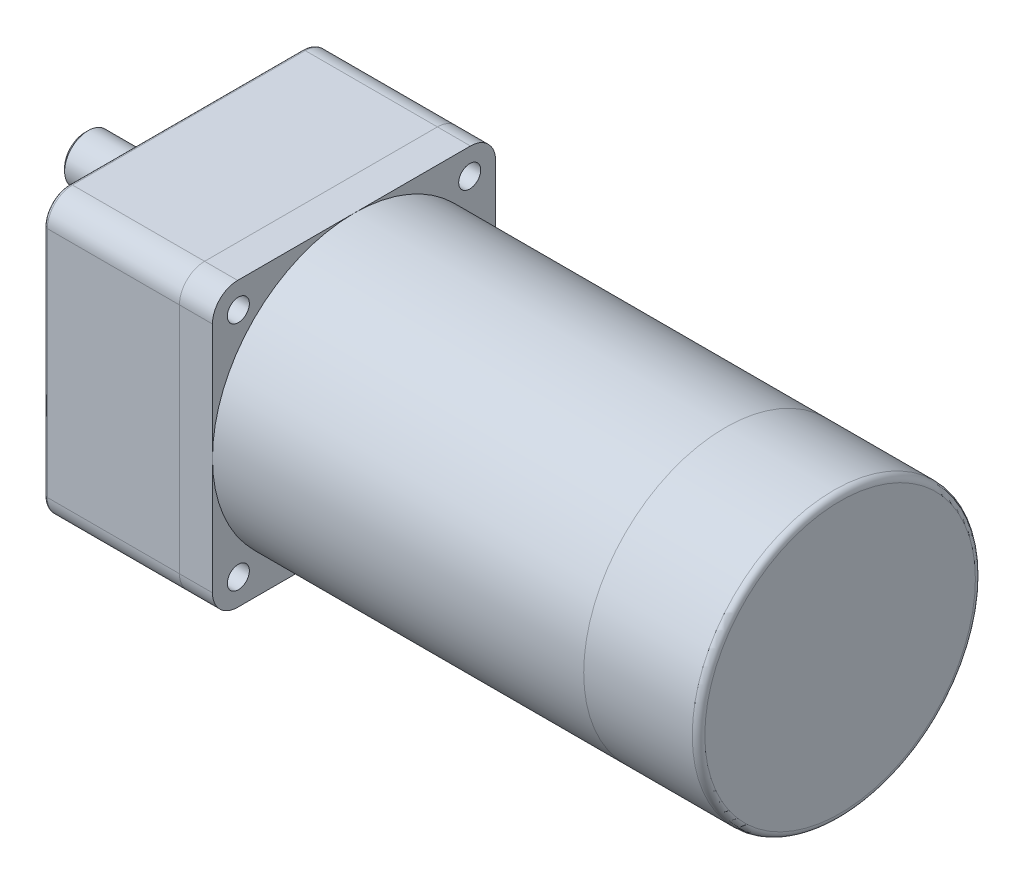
ISO-10303-21;
HEADER;
FILE_DESCRIPTION(('STEP AP214'),'2;1');
FILE_NAME('part.step','',(''),(''),'','','');
FILE_SCHEMA(('AUTOMOTIVE_DESIGN { 1 0 10303 214 1 1 1 1 }'));
ENDSEC;
DATA;
#1=APPLICATION_CONTEXT('core data for automotive mechanical design processes');
#2=APPLICATION_PROTOCOL_DEFINITION('international standard','automotive_design',2000,#1);
#3=PRODUCT_CONTEXT('',#1,'mechanical');
#4=PRODUCT('Part','Part','',(#3));
#5=PRODUCT_RELATED_PRODUCT_CATEGORY('part','',(#4));
#6=PRODUCT_DEFINITION_FORMATION('','',#4);
#7=PRODUCT_DEFINITION_CONTEXT('part definition',#1,'design');
#8=PRODUCT_DEFINITION('design','',#6,#7);
#9=PRODUCT_DEFINITION_SHAPE('','',#8);
#10=(LENGTH_UNIT() NAMED_UNIT(*) SI_UNIT(.MILLI.,.METRE.));
#11=(NAMED_UNIT(*) PLANE_ANGLE_UNIT() SI_UNIT($,.RADIAN.));
#12=(NAMED_UNIT(*) SI_UNIT($,.STERADIAN.) SOLID_ANGLE_UNIT());
#13=UNCERTAINTY_MEASURE_WITH_UNIT(LENGTH_MEASURE(1.E-05),#10,'distance_accuracy_value','');
#14=(GEOMETRIC_REPRESENTATION_CONTEXT(3) GLOBAL_UNCERTAINTY_ASSIGNED_CONTEXT((#13)) GLOBAL_UNIT_ASSIGNED_CONTEXT((#10,
#11,#12)) REPRESENTATION_CONTEXT('',''));
#15=CARTESIAN_POINT('',(0.,0.,0.));
#16=DIRECTION('',(0.,0.,1.));
#17=DIRECTION('',(1.,0.,0.));
#18=AXIS2_PLACEMENT_3D('',#15,#16,#17);
#19=CARTESIAN_POINT('',(208.,0.,0.));
#20=DIRECTION('',(-1.,0.,0.));
#21=DIRECTION('',(0.,0.,1.));
#22=AXIS2_PLACEMENT_3D('',#19,#20,#21);
#23=CYLINDRICAL_SURFACE('',#22,45.);
#24=CARTESIAN_POINT('',(206.,0.,0.));
#25=DIRECTION('',(1.,0.,0.));
#26=DIRECTION('',(0.,0.,-1.));
#27=AXIS2_PLACEMENT_3D('',#24,#25,#26);
#28=CIRCLE('',#27,45.);
#29=CARTESIAN_POINT('',(206.,0.,-45.));
#30=VERTEX_POINT('',#29);
#31=EDGE_CURVE('E11',#30,#30,#28,.F.);
#32=ORIENTED_EDGE('',*,*,#31,.T.);
#33=EDGE_LOOP('',(#32));
#34=FACE_BOUND('',#33,.T.);
#35=CARTESIAN_POINT('',(171.5,0.,0.));
#36=DIRECTION('',(1.,0.,0.));
#37=DIRECTION('',(0.,0.,-1.));
#38=AXIS2_PLACEMENT_3D('',#35,#36,#37);
#39=CIRCLE('',#38,45.);
#40=CARTESIAN_POINT('',(171.5,0.,-45.));
#41=VERTEX_POINT('',#40);
#42=EDGE_CURVE('E53',#41,#41,#39,.T.);
#43=ORIENTED_EDGE('',*,*,#42,.T.);
#44=EDGE_LOOP('',(#43));
#45=FACE_BOUND('',#44,.T.);
#46=ADVANCED_FACE('F42',(#34,#45),#23,.T.);
#47=CARTESIAN_POINT('',(208.,0.,0.));
#48=DIRECTION('',(1.,0.,0.));
#49=DIRECTION('',(0.,0.,-1.));
#50=AXIS2_PLACEMENT_3D('',#47,#48,#49);
#51=PLANE('',#50);
#52=CARTESIAN_POINT('',(208.,0.,0.));
#53=DIRECTION('',(1.,0.,0.));
#54=DIRECTION('',(0.,0.,-1.));
#55=AXIS2_PLACEMENT_3D('',#52,#53,#54);
#56=CIRCLE('',#55,43.);
#57=CARTESIAN_POINT('',(208.,0.,-43.));
#58=VERTEX_POINT('',#57);
#59=EDGE_CURVE('E49',#58,#58,#56,.T.);
#60=ORIENTED_EDGE('',*,*,#59,.T.);
#61=EDGE_LOOP('',(#60));
#62=FACE_BOUND('',#61,.T.);
#63=ADVANCED_FACE('F63',(#62),#51,.T.);
#64=CARTESIAN_POINT('',(171.5,0.,0.));
#65=DIRECTION('',(1.,0.,0.));
#66=DIRECTION('',(0.,0.,-1.));
#67=AXIS2_PLACEMENT_3D('',#64,#65,#66);
#68=PLANE('',#67);
#69=ORIENTED_EDGE('',*,*,#42,.F.);
#70=EDGE_LOOP('',(#69));
#71=FACE_BOUND('',#70,.T.);
#72=ADVANCED_FACE('F61',(#71),#68,.F.);
#73=CARTESIAN_POINT('',(206.,0.,0.));
#74=DIRECTION('',(1.,0.,0.));
#75=DIRECTION('',(0.,0.,-1.));
#76=AXIS2_PLACEMENT_3D('',#73,#74,#75);
#77=TOROIDAL_SURFACE('',#76,43.,2.);
#78=ORIENTED_EDGE('',*,*,#31,.F.);
#79=EDGE_LOOP('',(#78));
#80=FACE_BOUND('',#79,.T.);
#81=ORIENTED_EDGE('',*,*,#59,.F.);
#82=EDGE_LOOP('',(#81));
#83=FACE_BOUND('',#82,.T.);
#84=ADVANCED_FACE('F44',(#80,#83),#77,.T.);
#85=CLOSED_SHELL('',(#46,#63,#72,#84));
#86=MANIFOLD_SOLID_BREP('B2',#85);
#87=CARTESIAN_POINT('',(171.5,0.,0.));
#88=DIRECTION('',(-1.,0.,0.));
#89=DIRECTION('',(0.,0.,1.));
#90=AXIS2_PLACEMENT_3D('',#87,#88,#89);
#91=CYLINDRICAL_SURFACE('',#90,45.);
#92=CARTESIAN_POINT('',(171.5,0.,0.));
#93=DIRECTION('',(1.,0.,0.));
#94=DIRECTION('',(0.,0.,-1.));
#95=AXIS2_PLACEMENT_3D('',#92,#93,#94);
#96=CIRCLE('',#95,45.);
#97=CARTESIAN_POINT('',(171.5,0.,-45.));
#98=VERTEX_POINT('',#97);
#99=EDGE_CURVE('E41',#98,#98,#96,.T.);
#100=ORIENTED_EDGE('',*,*,#99,.F.);
#101=EDGE_LOOP('',(#100));
#102=FACE_BOUND('',#101,.T.);
#103=CARTESIAN_POINT('',(53.5,0.,0.));
#104=DIRECTION('',(1.,0.,0.));
#105=DIRECTION('',(0.,0.,-1.));
#106=AXIS2_PLACEMENT_3D('',#103,#104,#105);
#107=CIRCLE('',#106,45.);
#108=CARTESIAN_POINT('',(53.5,0.,-45.));
#109=VERTEX_POINT('',#108);
#110=EDGE_CURVE('E111',#109,#109,#107,.T.);
#111=ORIENTED_EDGE('',*,*,#110,.T.);
#112=EDGE_LOOP('',(#111));
#113=FACE_BOUND('',#112,.T.);
#114=ADVANCED_FACE('F108',(#102,#113),#91,.T.);
#115=CARTESIAN_POINT('',(171.5,0.,0.));
#116=DIRECTION('',(1.,0.,0.));
#117=DIRECTION('',(0.,0.,-1.));
#118=AXIS2_PLACEMENT_3D('',#115,#116,#117);
#119=PLANE('',#118);
#120=ORIENTED_EDGE('',*,*,#99,.T.);
#121=EDGE_LOOP('',(#120));
#122=FACE_BOUND('',#121,.T.);
#123=ADVANCED_FACE('F123',(#122),#119,.T.);
#124=CARTESIAN_POINT('',(53.5,0.,0.));
#125=DIRECTION('',(1.,0.,0.));
#126=DIRECTION('',(0.,0.,-1.));
#127=AXIS2_PLACEMENT_3D('',#124,#125,#126);
#128=PLANE('',#127);
#129=ORIENTED_EDGE('',*,*,#110,.F.);
#130=EDGE_LOOP('',(#129));
#131=FACE_BOUND('',#130,.T.);
#132=ADVANCED_FACE('F121',(#131),#128,.F.);
#133=CLOSED_SHELL('',(#114,#123,#132));
#134=MANIFOLD_SOLID_BREP('B6',#133);
#135=CARTESIAN_POINT('',(-32.,18.,0.));
#136=DIRECTION('',(1.,0.,0.));
#137=DIRECTION('',(0.,0.,-1.));
#138=AXIS2_PLACEMENT_3D('',#135,#136,#137);
#139=CYLINDRICAL_SURFACE('',#138,7.5);
#140=CARTESIAN_POINT('',(-3.,18.,0.));
#141=DIRECTION('',(-1.,0.,0.));
#142=DIRECTION('',(0.,0.,1.));
#143=AXIS2_PLACEMENT_3D('',#140,#141,#142);
#144=CIRCLE('',#143,7.5);
#145=CARTESIAN_POINT('',(-3.,18.,7.5));
#146=VERTEX_POINT('',#145);
#147=EDGE_CURVE('E237',#146,#146,#144,.T.);
#148=ORIENTED_EDGE('',*,*,#147,.T.);
#149=EDGE_LOOP('',(#148));
#150=FACE_BOUND('',#149,.T.);
#151=DIRECTION('',(1.,0.,0.));
#152=VECTOR('',#151,1.);
#153=CARTESIAN_POINT('',(-32.,20.5,-7.07106781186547));
#154=LINE('',#153,#152);
#155=CARTESIAN_POINT('',(-31.,20.5,-7.07106781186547));
#156=VERTEX_POINT('',#155);
#157=CARTESIAN_POINT('',(-9.5,20.5,-7.07106781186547));
#158=VERTEX_POINT('',#157);
#159=EDGE_CURVE('E226',#156,#158,#154,.T.);
#160=ORIENTED_EDGE('',*,*,#159,.F.);
#161=CARTESIAN_POINT('',(-31.,18.,0.));
#162=DIRECTION('',(-1.,0.,0.));
#163=DIRECTION('',(0.,0.,1.));
#164=AXIS2_PLACEMENT_3D('',#161,#162,#163);
#165=CIRCLE('',#164,7.5);
#166=CARTESIAN_POINT('',(-31.,15.5,-7.07106781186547));
#167=VERTEX_POINT('',#166);
#168=EDGE_CURVE('E170',#156,#167,#165,.F.);
#169=ORIENTED_EDGE('',*,*,#168,.T.);
#170=DIRECTION('',(1.,0.,0.));
#171=VECTOR('',#170,1.);
#172=CARTESIAN_POINT('',(-32.,15.5,-7.07106781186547));
#173=LINE('',#172,#171);
#174=CARTESIAN_POINT('',(-9.5,15.5,-7.07106781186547));
#175=VERTEX_POINT('',#174);
#176=EDGE_CURVE('E228',#175,#167,#173,.F.);
#177=ORIENTED_EDGE('',*,*,#176,.F.);
#178=CARTESIAN_POINT('',(-9.5,20.5,-7.07106781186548));
#179=CARTESIAN_POINT('',(-9.43179292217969,20.5000089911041,-7.07105693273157));
#180=CARTESIAN_POINT('',(-9.36359192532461,20.4972088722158,-7.07205443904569));
#181=CARTESIAN_POINT('',(-9.22771896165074,20.4860604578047,-7.07598524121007));
#182=CARTESIAN_POINT('',(-9.16004685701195,20.477713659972,-7.07891801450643));
#183=CARTESIAN_POINT('',(-9.02590951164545,20.455574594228,-7.08662705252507));
#184=CARTESIAN_POINT('',(-8.95944129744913,20.4417984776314,-7.09139784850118));
#185=CARTESIAN_POINT('',(-8.8279917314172,20.4089418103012,-7.10262619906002));
#186=CARTESIAN_POINT('',(-8.7630104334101,20.3898610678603,-7.10908381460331));
#187=CARTESIAN_POINT('',(-8.57103842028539,20.324915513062,-7.13069940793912));
#188=CARTESIAN_POINT('',(-8.44682084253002,20.2713141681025,-7.14811243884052));
#189=CARTESIAN_POINT('',(-8.20912318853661,20.1451778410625,-7.1869703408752));
#190=CARTESIAN_POINT('',(-8.09564976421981,20.0726312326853,-7.20841768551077));
#191=CARTESIAN_POINT('',(-7.8782070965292,19.9076299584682,-7.25386182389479));
#192=CARTESIAN_POINT('',(-7.7747148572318,19.8145628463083,-7.27792189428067));
#193=CARTESIAN_POINT('',(-7.5844828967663,19.6124707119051,-7.32534626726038));
#194=CARTESIAN_POINT('',(-7.497746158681,19.5034428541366,-7.34871044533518));
#195=CARTESIAN_POINT('',(-7.34130177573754,19.2690092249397,-7.39284706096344));
#196=CARTESIAN_POINT('',(-7.27209769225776,19.1432502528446,-7.41353593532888));
#197=CARTESIAN_POINT('',(-7.1560192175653,18.8810730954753,-7.44924021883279));
#198=CARTESIAN_POINT('',(-7.10913800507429,18.7446581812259,-7.46425736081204));
#199=CARTESIAN_POINT('',(-7.04066072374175,18.4700733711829,-7.48647677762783));
#200=CARTESIAN_POINT('',(-7.01824182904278,18.3321295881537,-7.49393272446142));
#201=CARTESIAN_POINT('',(-6.99670924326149,18.0542474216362,-7.50109021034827));
#202=CARTESIAN_POINT('',(-6.99758999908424,17.9143095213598,-7.50079359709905));
#203=CARTESIAN_POINT('',(-7.0221107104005,17.6422403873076,-7.49265096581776));
#204=CARTESIAN_POINT('',(-7.04485659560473,17.5100182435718,-7.48510152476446));
#205=CARTESIAN_POINT('',(-7.1109829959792,17.2513898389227,-7.46367401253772));
#206=CARTESIAN_POINT('',(-7.15436465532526,17.1249839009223,-7.44979559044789));
#207=CARTESIAN_POINT('',(-7.26105342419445,16.8796184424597,-7.41689170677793));
#208=CARTESIAN_POINT('',(-7.32461511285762,16.760778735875,-7.39780094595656));
#209=CARTESIAN_POINT('',(-7.46964987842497,16.5351885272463,-7.35645969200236));
#210=CARTESIAN_POINT('',(-7.55112782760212,16.4284413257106,-7.33420833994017));
#211=CARTESIAN_POINT('',(-7.73417762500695,16.2247566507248,-7.28765679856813));
#212=CARTESIAN_POINT('',(-7.83651385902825,16.128515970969,-7.26330946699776));
#213=CARTESIAN_POINT('',(-8.05610372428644,15.9543199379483,-7.21618726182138));
#214=CARTESIAN_POINT('',(-8.17336215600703,15.8763704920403,-7.19341289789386));
#215=CARTESIAN_POINT('',(-8.42170044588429,15.7399916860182,-7.15175078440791));
#216=CARTESIAN_POINT('',(-8.55295878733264,15.6818674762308,-7.13292537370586));
#217=CARTESIAN_POINT('',(-8.8241174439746,15.5888494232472,-7.10202742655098));
#218=CARTESIAN_POINT('',(-8.96400373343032,15.5539189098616,-7.08994423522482));
#219=CARTESIAN_POINT('',(-9.17104659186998,15.5208546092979,-7.078413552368));
#220=CARTESIAN_POINT('',(-9.23660347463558,15.5130373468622,-7.07566669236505));
#221=CARTESIAN_POINT('',(-9.36809519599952,15.502613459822,-7.07199258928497));
#222=CARTESIAN_POINT('',(-9.43402943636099,15.5000001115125,-7.0710629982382));
#223=CARTESIAN_POINT('',(-9.5,15.5,-7.07106781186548));
#224=B_SPLINE_CURVE_WITH_KNOTS('',3,(#178,#179,#180,#181,#182,#183,#184,#185,#186,#187,#188,
#189,#190,#191,#192,#193,#194,#195,#196,#197,#198,#199,#200,#201,#202,#203,#204,#205,#206,#207,
#208,#209,#210,#211,#212,#213,#214,#215,#216,#217,#218,#219,#220,#221,#222,#223),.UNSPECIFIED.,
.F.,.F.,(4,2,2,2,2,2,2,2,2,2,2,2,2,2,2,2,2,2,2,2,2,2,4),(0.,0.20454621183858,0.409037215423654,
0.612924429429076,0.816819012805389,1.22401016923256,1.63145179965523,2.0532786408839,
2.47518051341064,2.90809434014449,3.34087579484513,3.75860278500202,4.17623021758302,
4.57747647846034,4.97874498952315,5.38529148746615,5.79194868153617,6.21771736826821,
6.64362337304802,7.07581676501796,7.50732520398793,7.70536340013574,7.90314555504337),.UNSPECIFIED.);
#225=EDGE_CURVE('E240',#158,#175,#224,.T.);
#226=ORIENTED_EDGE('',*,*,#225,.F.);
#227=EDGE_LOOP('',(#160,#169,#177,#226));
#228=FACE_BOUND('',#227,.T.);
#229=ADVANCED_FACE('F157',(#150,#228),#139,.T.);
#230=CARTESIAN_POINT('',(-32.,18.,0.));
#231=DIRECTION('',(-1.,0.,0.));
#232=DIRECTION('',(0.,0.,1.));
#233=AXIS2_PLACEMENT_3D('',#230,#231,#232);
#234=PLANE('',#233);
#235=DIRECTION('',(0.,0.,-1.));
#236=VECTOR('',#235,1.);
#237=CARTESIAN_POINT('',(-32.,15.5,-4.5));
#238=LINE('',#237,#236);
#239=CARTESIAN_POINT('',(-32.,15.5,-4.5));
#240=VERTEX_POINT('',#239);
#241=CARTESIAN_POINT('',(-32.,15.5,-6.00000000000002));
#242=VERTEX_POINT('',#241);
#243=EDGE_CURVE('E232',#240,#242,#238,.T.);
#244=ORIENTED_EDGE('',*,*,#243,.T.);
#245=CARTESIAN_POINT('',(-32.,18.,0.));
#246=DIRECTION('',(-1.,0.,0.));
#247=DIRECTION('',(0.,0.,1.));
#248=AXIS2_PLACEMENT_3D('',#245,#246,#247);
#249=CIRCLE('',#248,6.50000000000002);
#250=CARTESIAN_POINT('',(-32.,20.5,-6.00000000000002));
#251=VERTEX_POINT('',#250);
#252=EDGE_CURVE('E246',#242,#251,#249,.T.);
#253=ORIENTED_EDGE('',*,*,#252,.T.);
#254=DIRECTION('',(0.,0.,-1.));
#255=VECTOR('',#254,1.);
#256=CARTESIAN_POINT('',(-32.,20.5,-4.5));
#257=LINE('',#256,#255);
#258=CARTESIAN_POINT('',(-32.,20.5,-4.5));
#259=VERTEX_POINT('',#258);
#260=EDGE_CURVE('E229',#259,#251,#257,.T.);
#261=ORIENTED_EDGE('',*,*,#260,.F.);
#262=DIRECTION('',(0.,-1.,0.));
#263=VECTOR('',#262,1.);
#264=CARTESIAN_POINT('',(-32.,20.5,-4.5));
#265=LINE('',#264,#263);
#266=EDGE_CURVE('E213',#259,#240,#265,.T.);
#267=ORIENTED_EDGE('',*,*,#266,.T.);
#268=EDGE_LOOP('',(#244,#253,#261,#267));
#269=FACE_BOUND('',#268,.T.);
#270=ADVANCED_FACE('F256',(#269),#234,.T.);
#271=CARTESIAN_POINT('',(-3.,18.,0.));
#272=DIRECTION('',(-1.,0.,0.));
#273=DIRECTION('',(0.,0.,1.));
#274=AXIS2_PLACEMENT_3D('',#271,#272,#273);
#275=PLANE('',#274);
#276=ORIENTED_EDGE('',*,*,#147,.F.);
#277=EDGE_LOOP('',(#276));
#278=FACE_BOUND('',#277,.T.);
#279=ADVANCED_FACE('F254',(#278),#275,.F.);
#280=CARTESIAN_POINT('',(-9.5,18.,-4.5));
#281=DIRECTION('',(0.,0.,-1.));
#282=DIRECTION('',(-1.,0.,0.));
#283=AXIS2_PLACEMENT_3D('',#280,#281,#282);
#284=CYLINDRICAL_SURFACE('',#283,2.5);
#285=DIRECTION('',(0.,0.,-1.));
#286=VECTOR('',#285,1.);
#287=CARTESIAN_POINT('',(-9.5,20.5,-4.5));
#288=LINE('',#287,#286);
#289=CARTESIAN_POINT('',(-9.5,20.5,-4.5));
#290=VERTEX_POINT('',#289);
#291=EDGE_CURVE('E221',#290,#158,#288,.T.);
#292=ORIENTED_EDGE('',*,*,#291,.T.);
#293=ORIENTED_EDGE('',*,*,#225,.T.);
#294=DIRECTION('',(0.,0.,-1.));
#295=VECTOR('',#294,1.);
#296=CARTESIAN_POINT('',(-9.5,15.5,-4.5));
#297=LINE('',#296,#295);
#298=CARTESIAN_POINT('',(-9.5,15.5,-4.5));
#299=VERTEX_POINT('',#298);
#300=EDGE_CURVE('E223',#299,#175,#297,.T.);
#301=ORIENTED_EDGE('',*,*,#300,.F.);
#302=CARTESIAN_POINT('',(-9.5,18.,-4.5));
#303=DIRECTION('',(0.,0.,1.));
#304=DIRECTION('',(1.,0.,0.));
#305=AXIS2_PLACEMENT_3D('',#302,#303,#304);
#306=CIRCLE('',#305,2.5);
#307=EDGE_CURVE('E211',#299,#290,#306,.T.);
#308=ORIENTED_EDGE('',*,*,#307,.T.);
#309=EDGE_LOOP('',(#292,#293,#301,#308));
#310=FACE_BOUND('',#309,.T.);
#311=ADVANCED_FACE('F220',(#310),#284,.F.);
#312=CARTESIAN_POINT('',(-9.5,20.5,-4.5));
#313=DIRECTION('',(0.,-1.,0.));
#314=DIRECTION('',(0.,0.,-1.));
#315=AXIS2_PLACEMENT_3D('',#312,#313,#314);
#316=PLANE('',#315);
#317=ORIENTED_EDGE('',*,*,#260,.T.);
#318=CARTESIAN_POINT('',(-32.,20.5,-6.00000000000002));
#319=CARTESIAN_POINT('',(-31.9171731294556,20.5,-6.0897273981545));
#320=CARTESIAN_POINT('',(-31.8341996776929,20.5,-6.17931930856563));
#321=CARTESIAN_POINT('',(-31.6679908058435,20.5,-6.35825867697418));
#322=CARTESIAN_POINT('',(-31.5847553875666,20.5,-6.44760613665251));
#323=CARTESIAN_POINT('',(-31.4180527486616,20.5,-6.62608424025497));
#324=CARTESIAN_POINT('',(-31.3345855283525,20.5,-6.7152148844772));
#325=CARTESIAN_POINT('',(-31.1674427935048,20.5,-6.89328182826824));
#326=CARTESIAN_POINT('',(-31.0837672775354,20.5,-6.98221812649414));
#327=CARTESIAN_POINT('',(-31.,20.5,-7.07106781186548));
#328=B_SPLINE_CURVE_WITH_KNOTS('',3,(#318,#319,#320,#321,#322,#323,#324,#325,#326,#327),
.UNSPECIFIED.,.F.,.F.,(4,2,2,2,4),(0.,0.366335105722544,0.732667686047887,1.0989997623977,
1.46533436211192),.UNSPECIFIED.);
#329=EDGE_CURVE('E184',#251,#156,#328,.T.);
#330=ORIENTED_EDGE('',*,*,#329,.T.);
#331=ORIENTED_EDGE('',*,*,#159,.T.);
#332=ORIENTED_EDGE('',*,*,#291,.F.);
#333=DIRECTION('',(-1.,0.,0.));
#334=VECTOR('',#333,1.);
#335=CARTESIAN_POINT('',(-9.5,20.5,-4.5));
#336=LINE('',#335,#334);
#337=EDGE_CURVE('E208',#290,#259,#336,.T.);
#338=ORIENTED_EDGE('',*,*,#337,.T.);
#339=EDGE_LOOP('',(#317,#330,#331,#332,#338));
#340=FACE_BOUND('',#339,.T.);
#341=ADVANCED_FACE('F225',(#340),#316,.T.);
#342=CARTESIAN_POINT('',(-32.,15.5,-4.5));
#343=DIRECTION('',(0.,1.,0.));
#344=DIRECTION('',(0.,0.,1.));
#345=AXIS2_PLACEMENT_3D('',#342,#343,#344);
#346=PLANE('',#345);
#347=ORIENTED_EDGE('',*,*,#176,.T.);
#348=CARTESIAN_POINT('',(-31.,15.5,-7.07106781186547));
#349=CARTESIAN_POINT('',(-31.0837672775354,15.5,-6.98221812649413));
#350=CARTESIAN_POINT('',(-31.1674427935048,15.5,-6.89328182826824));
#351=CARTESIAN_POINT('',(-31.3345855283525,15.5,-6.7152148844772));
#352=CARTESIAN_POINT('',(-31.4180527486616,15.5,-6.62608424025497));
#353=CARTESIAN_POINT('',(-31.5847553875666,15.5,-6.44760613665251));
#354=CARTESIAN_POINT('',(-31.6679908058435,15.5,-6.35825867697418));
#355=CARTESIAN_POINT('',(-31.8341996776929,15.5,-6.17931930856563));
#356=CARTESIAN_POINT('',(-31.9171731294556,15.5,-6.08972739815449));
#357=CARTESIAN_POINT('',(-32.,15.5,-6.00000000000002));
#358=B_SPLINE_CURVE_WITH_KNOTS('',3,(#348,#349,#350,#351,#352,#353,#354,#355,#356,#357),
.UNSPECIFIED.,.F.,.F.,(4,2,2,2,4),(0.,0.366334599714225,0.732666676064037,1.09899925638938,
1.46533436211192),.UNSPECIFIED.);
#359=EDGE_CURVE('E106',#167,#242,#358,.T.);
#360=ORIENTED_EDGE('',*,*,#359,.T.);
#361=ORIENTED_EDGE('',*,*,#243,.F.);
#362=DIRECTION('',(1.,0.,0.));
#363=VECTOR('',#362,1.);
#364=CARTESIAN_POINT('',(-32.,15.5,-4.5));
#365=LINE('',#364,#363);
#366=EDGE_CURVE('E278',#240,#299,#365,.T.);
#367=ORIENTED_EDGE('',*,*,#366,.T.);
#368=ORIENTED_EDGE('',*,*,#300,.T.);
#369=EDGE_LOOP('',(#347,#360,#361,#367,#368));
#370=FACE_BOUND('',#369,.T.);
#371=ADVANCED_FACE('F282',(#370),#346,.T.);
#372=CARTESIAN_POINT('',(-9.5,18.,-4.5));
#373=DIRECTION('',(0.,0.,1.));
#374=DIRECTION('',(1.,0.,0.));
#375=AXIS2_PLACEMENT_3D('',#372,#373,#374);
#376=PLANE('',#375);
#377=ORIENTED_EDGE('',*,*,#307,.F.);
#378=ORIENTED_EDGE('',*,*,#366,.F.);
#379=ORIENTED_EDGE('',*,*,#266,.F.);
#380=ORIENTED_EDGE('',*,*,#337,.F.);
#381=EDGE_LOOP('',(#377,#378,#379,#380));
#382=FACE_BOUND('',#381,.T.);
#383=ADVANCED_FACE('F210',(#382),#376,.F.);
#384=CARTESIAN_POINT('',(-32.,18.,0.));
#385=DIRECTION('',(1.,0.,0.));
#386=DIRECTION('',(0.,0.,-1.));
#387=AXIS2_PLACEMENT_3D('',#384,#385,#386);
#388=CONICAL_SURFACE('',#387,6.50000000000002,0.785398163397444);
#389=ORIENTED_EDGE('',*,*,#359,.F.);
#390=ORIENTED_EDGE('',*,*,#168,.F.);
#391=ORIENTED_EDGE('',*,*,#329,.F.);
#392=ORIENTED_EDGE('',*,*,#252,.F.);
#393=EDGE_LOOP('',(#389,#390,#391,#392));
#394=FACE_BOUND('',#393,.T.);
#395=ADVANCED_FACE('F159',(#394),#388,.T.);
#396=CLOSED_SHELL('',(#229,#270,#279,#311,#341,#371,#383,#395));
#397=MANIFOLD_SOLID_BREP('B36',#396);
#398=CARTESIAN_POINT('',(-3.,18.,0.));
#399=DIRECTION('',(1.,0.,0.));
#400=DIRECTION('',(0.,0.,-1.));
#401=AXIS2_PLACEMENT_3D('',#398,#399,#400);
#402=CYLINDRICAL_SURFACE('',#401,16.);
#403=CARTESIAN_POINT('',(-2.5,18.,0.));
#404=DIRECTION('',(-1.,0.,0.));
#405=DIRECTION('',(0.,0.,1.));
#406=AXIS2_PLACEMENT_3D('',#403,#404,#405);
#407=CIRCLE('',#406,16.);
#408=CARTESIAN_POINT('',(-2.5,18.,16.));
#409=VERTEX_POINT('',#408);
#410=EDGE_CURVE('E156',#409,#409,#407,.F.);
#411=ORIENTED_EDGE('',*,*,#410,.T.);
#412=EDGE_LOOP('',(#411));
#413=FACE_BOUND('',#412,.T.);
#414=CARTESIAN_POINT('',(0.,18.,0.));
#415=DIRECTION('',(-1.,0.,0.));
#416=DIRECTION('',(0.,0.,1.));
#417=AXIS2_PLACEMENT_3D('',#414,#415,#416);
#418=CIRCLE('',#417,16.);
#419=CARTESIAN_POINT('',(0.,18.,16.));
#420=VERTEX_POINT('',#419);
#421=EDGE_CURVE('E358',#420,#420,#418,.T.);
#422=ORIENTED_EDGE('',*,*,#421,.T.);
#423=EDGE_LOOP('',(#422));
#424=FACE_BOUND('',#423,.T.);
#425=ADVANCED_FACE('F347',(#413,#424),#402,.T.);
#426=CARTESIAN_POINT('',(-3.,18.,0.));
#427=DIRECTION('',(-1.,0.,0.));
#428=DIRECTION('',(0.,0.,1.));
#429=AXIS2_PLACEMENT_3D('',#426,#427,#428);
#430=PLANE('',#429);
#431=CARTESIAN_POINT('',(-3.,18.,0.));
#432=DIRECTION('',(-1.,0.,0.));
#433=DIRECTION('',(0.,0.,1.));
#434=AXIS2_PLACEMENT_3D('',#431,#432,#433);
#435=CIRCLE('',#434,15.5);
#436=CARTESIAN_POINT('',(-3.,18.,15.5));
#437=VERTEX_POINT('',#436);
#438=EDGE_CURVE('E354',#437,#437,#435,.T.);
#439=ORIENTED_EDGE('',*,*,#438,.T.);
#440=EDGE_LOOP('',(#439));
#441=FACE_BOUND('',#440,.T.);
#442=ADVANCED_FACE('F368',(#441),#430,.T.);
#443=CARTESIAN_POINT('',(0.,18.,0.));
#444=DIRECTION('',(-1.,0.,0.));
#445=DIRECTION('',(0.,0.,1.));
#446=AXIS2_PLACEMENT_3D('',#443,#444,#445);
#447=PLANE('',#446);
#448=ORIENTED_EDGE('',*,*,#421,.F.);
#449=EDGE_LOOP('',(#448));
#450=FACE_BOUND('',#449,.T.);
#451=ADVANCED_FACE('F366',(#450),#447,.F.);
#452=CARTESIAN_POINT('',(-2.5,18.,0.));
#453=DIRECTION('',(-1.,0.,0.));
#454=DIRECTION('',(0.,0.,1.));
#455=AXIS2_PLACEMENT_3D('',#452,#453,#454);
#456=TOROIDAL_SURFACE('',#455,15.5,0.5);
#457=ORIENTED_EDGE('',*,*,#410,.F.);
#458=EDGE_LOOP('',(#457));
#459=FACE_BOUND('',#458,.T.);
#460=ORIENTED_EDGE('',*,*,#438,.F.);
#461=EDGE_LOOP('',(#460));
#462=FACE_BOUND('',#461,.T.);
#463=ADVANCED_FACE('F349',(#459,#462),#456,.T.);
#464=CLOSED_SHELL('',(#425,#442,#451,#463));
#465=MANIFOLD_SOLID_BREP('B100',#464);
#466=CARTESIAN_POINT('',(53.5,37.,-37.));
#467=DIRECTION('',(-1.,0.,0.));
#468=DIRECTION('',(0.,0.,1.));
#469=AXIS2_PLACEMENT_3D('',#466,#467,#468);
#470=CYLINDRICAL_SURFACE('',#469,8.);
#471=CARTESIAN_POINT('',(43.,37.,-37.));
#472=DIRECTION('',(1.,0.,0.));
#473=DIRECTION('',(0.,0.,1.));
#474=AXIS2_PLACEMENT_3D('',#471,#472,#473);
#475=CIRCLE('',#474,8.);
#476=CARTESIAN_POINT('',(43.,37.,-45.));
#477=VERTEX_POINT('',#476);
#478=CARTESIAN_POINT('',(43.,45.,-36.9999999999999));
#479=VERTEX_POINT('',#478);
#480=EDGE_CURVE('E510',#477,#479,#475,.T.);
#481=ORIENTED_EDGE('',*,*,#480,.T.);
#482=DIRECTION('',(-1.,0.,0.));
#483=VECTOR('',#482,1.);
#484=CARTESIAN_POINT('',(53.5,45.,-36.9999999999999));
#485=LINE('',#484,#483);
#486=CARTESIAN_POINT('',(53.5,45.,-36.9999999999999));
#487=VERTEX_POINT('',#486);
#488=EDGE_CURVE('E345',#487,#479,#485,.T.);
#489=ORIENTED_EDGE('',*,*,#488,.F.);
#490=CARTESIAN_POINT('',(53.5,37.,-37.));
#491=DIRECTION('',(1.,0.,0.));
#492=DIRECTION('',(0.,0.,1.));
#493=AXIS2_PLACEMENT_3D('',#490,#491,#492);
#494=CIRCLE('',#493,8.);
#495=CARTESIAN_POINT('',(53.5,37.,-45.));
#496=VERTEX_POINT('',#495);
#497=EDGE_CURVE('E524',#496,#487,#494,.T.);
#498=ORIENTED_EDGE('',*,*,#497,.F.);
#499=DIRECTION('',(-1.,0.,0.));
#500=VECTOR('',#499,1.);
#501=CARTESIAN_POINT('',(53.5,37.,-45.));
#502=LINE('',#501,#500);
#503=EDGE_CURVE('E506',#496,#477,#502,.T.);
#504=ORIENTED_EDGE('',*,*,#503,.T.);
#505=EDGE_LOOP('',(#481,#489,#498,#504));
#506=FACE_BOUND('',#505,.T.);
#507=ADVANCED_FACE('F412',(#506),#470,.T.);
#508=CARTESIAN_POINT('',(53.5,45.,36.9999999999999));
#509=DIRECTION('',(0.,-1.,0.));
#510=DIRECTION('',(0.,0.,-1.));
#511=AXIS2_PLACEMENT_3D('',#508,#509,#510);
#512=PLANE('',#511);
#513=DIRECTION('',(0.,0.,1.));
#514=VECTOR('',#513,1.);
#515=CARTESIAN_POINT('',(43.,45.,36.9999999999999));
#516=LINE('',#515,#514);
#517=CARTESIAN_POINT('',(43.,45.,36.9999999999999));
#518=VERTEX_POINT('',#517);
#519=EDGE_CURVE('E513',#479,#518,#516,.T.);
#520=ORIENTED_EDGE('',*,*,#519,.T.);
#521=DIRECTION('',(-1.,0.,0.));
#522=VECTOR('',#521,1.);
#523=CARTESIAN_POINT('',(53.5,45.,36.9999999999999));
#524=LINE('',#523,#522);
#525=CARTESIAN_POINT('',(53.5,45.,36.9999999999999));
#526=VERTEX_POINT('',#525);
#527=EDGE_CURVE('E421',#526,#518,#524,.T.);
#528=ORIENTED_EDGE('',*,*,#527,.F.);
#529=DIRECTION('',(0.,0.,1.));
#530=VECTOR('',#529,1.);
#531=CARTESIAN_POINT('',(53.5,45.,36.9999999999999));
#532=LINE('',#531,#530);
#533=EDGE_CURVE('E473',#487,#526,#532,.T.);
#534=ORIENTED_EDGE('',*,*,#533,.F.);
#535=ORIENTED_EDGE('',*,*,#488,.T.);
#536=EDGE_LOOP('',(#520,#528,#534,#535));
#537=FACE_BOUND('',#536,.T.);
#538=ADVANCED_FACE('F578',(#537),#512,.F.);
#539=CARTESIAN_POINT('',(53.5,37.,37.));
#540=DIRECTION('',(-1.,0.,0.));
#541=DIRECTION('',(0.,0.,1.));
#542=AXIS2_PLACEMENT_3D('',#539,#540,#541);
#543=CYLINDRICAL_SURFACE('',#542,8.);
#544=CARTESIAN_POINT('',(43.,37.,37.));
#545=DIRECTION('',(1.,0.,0.));
#546=DIRECTION('',(0.,0.,1.));
#547=AXIS2_PLACEMENT_3D('',#544,#545,#546);
#548=CIRCLE('',#547,8.);
#549=CARTESIAN_POINT('',(43.,37.,45.));
#550=VERTEX_POINT('',#549);
#551=EDGE_CURVE('E515',#518,#550,#548,.T.);
#552=ORIENTED_EDGE('',*,*,#551,.T.);
#553=DIRECTION('',(-1.,0.,0.));
#554=VECTOR('',#553,1.);
#555=CARTESIAN_POINT('',(53.5,37.,45.));
#556=LINE('',#555,#554);
#557=CARTESIAN_POINT('',(53.5,37.,45.));
#558=VERTEX_POINT('',#557);
#559=EDGE_CURVE('E531',#558,#550,#556,.T.);
#560=ORIENTED_EDGE('',*,*,#559,.F.);
#561=CARTESIAN_POINT('',(53.5,37.,37.));
#562=DIRECTION('',(1.,0.,0.));
#563=DIRECTION('',(0.,0.,1.));
#564=AXIS2_PLACEMENT_3D('',#561,#562,#563);
#565=CIRCLE('',#564,8.);
#566=EDGE_CURVE('E679',#526,#558,#565,.T.);
#567=ORIENTED_EDGE('',*,*,#566,.F.);
#568=ORIENTED_EDGE('',*,*,#527,.T.);
#569=EDGE_LOOP('',(#552,#560,#567,#568));
#570=FACE_BOUND('',#569,.T.);
#571=ADVANCED_FACE('F582',(#570),#543,.T.);
#572=CARTESIAN_POINT('',(53.5,-37.,45.));
#573=DIRECTION('',(0.,0.,-1.));
#574=DIRECTION('',(-1.,0.,0.));
#575=AXIS2_PLACEMENT_3D('',#572,#573,#574);
#576=PLANE('',#575);
#577=DIRECTION('',(0.,-1.,0.));
#578=VECTOR('',#577,1.);
#579=CARTESIAN_POINT('',(43.,-37.,45.));
#580=LINE('',#579,#578);
#581=CARTESIAN_POINT('',(43.,-37.,45.));
#582=VERTEX_POINT('',#581);
#583=EDGE_CURVE('E517',#550,#582,#580,.T.);
#584=ORIENTED_EDGE('',*,*,#583,.T.);
#585=DIRECTION('',(-1.,0.,0.));
#586=VECTOR('',#585,1.);
#587=CARTESIAN_POINT('',(53.5,-37.,45.));
#588=LINE('',#587,#586);
#589=CARTESIAN_POINT('',(53.5,-37.,45.));
#590=VERTEX_POINT('',#589);
#591=EDGE_CURVE('E528',#590,#582,#588,.T.);
#592=ORIENTED_EDGE('',*,*,#591,.F.);
#593=DIRECTION('',(0.,-1.,0.));
#594=VECTOR('',#593,1.);
#595=CARTESIAN_POINT('',(53.5,-37.,45.));
#596=LINE('',#595,#594);
#597=EDGE_CURVE('E681',#558,#590,#596,.T.);
#598=ORIENTED_EDGE('',*,*,#597,.F.);
#599=ORIENTED_EDGE('',*,*,#559,.T.);
#600=EDGE_LOOP('',(#584,#592,#598,#599));
#601=FACE_BOUND('',#600,.T.);
#602=ADVANCED_FACE('F586',(#601),#576,.F.);
#603=CARTESIAN_POINT('',(53.5,-37.,37.));
#604=DIRECTION('',(-1.,0.,0.));
#605=DIRECTION('',(0.,0.,1.));
#606=AXIS2_PLACEMENT_3D('',#603,#604,#605);
#607=CYLINDRICAL_SURFACE('',#606,8.);
#608=CARTESIAN_POINT('',(43.,-37.,37.));
#609=DIRECTION('',(1.,0.,0.));
#610=DIRECTION('',(0.,0.,1.));
#611=AXIS2_PLACEMENT_3D('',#608,#609,#610);
#612=CIRCLE('',#611,8.);
#613=CARTESIAN_POINT('',(43.,-45.,36.9999999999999));
#614=VERTEX_POINT('',#613);
#615=EDGE_CURVE('E519',#582,#614,#612,.T.);
#616=ORIENTED_EDGE('',*,*,#615,.T.);
#617=DIRECTION('',(-1.,0.,0.));
#618=VECTOR('',#617,1.);
#619=CARTESIAN_POINT('',(53.5,-45.,36.9999999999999));
#620=LINE('',#619,#618);
#621=CARTESIAN_POINT('',(53.5,-45.,36.9999999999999));
#622=VERTEX_POINT('',#621);
#623=EDGE_CURVE('E501',#622,#614,#620,.T.);
#624=ORIENTED_EDGE('',*,*,#623,.F.);
#625=CARTESIAN_POINT('',(53.5,-37.,37.));
#626=DIRECTION('',(1.,0.,0.));
#627=DIRECTION('',(0.,0.,1.));
#628=AXIS2_PLACEMENT_3D('',#625,#626,#627);
#629=CIRCLE('',#628,8.);
#630=EDGE_CURVE('E492',#590,#622,#629,.T.);
#631=ORIENTED_EDGE('',*,*,#630,.F.);
#632=ORIENTED_EDGE('',*,*,#591,.T.);
#633=EDGE_LOOP('',(#616,#624,#631,#632));
#634=FACE_BOUND('',#633,.T.);
#635=ADVANCED_FACE('F592',(#634),#607,.T.);
#636=CARTESIAN_POINT('',(53.5,-45.,36.9999999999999));
#637=DIRECTION('',(0.,1.,0.));
#638=DIRECTION('',(0.,0.,1.));
#639=AXIS2_PLACEMENT_3D('',#636,#637,#638);
#640=PLANE('',#639);
#641=DIRECTION('',(0.,0.,-1.));
#642=VECTOR('',#641,1.);
#643=CARTESIAN_POINT('',(43.,-45.,36.9999999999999));
#644=LINE('',#643,#642);
#645=CARTESIAN_POINT('',(43.,-45.,-36.9999999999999));
#646=VERTEX_POINT('',#645);
#647=EDGE_CURVE('E500',#614,#646,#644,.T.);
#648=ORIENTED_EDGE('',*,*,#647,.T.);
#649=DIRECTION('',(-1.,0.,0.));
#650=VECTOR('',#649,1.);
#651=CARTESIAN_POINT('',(53.5,-45.,-36.9999999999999));
#652=LINE('',#651,#650);
#653=CARTESIAN_POINT('',(53.5,-45.,-36.9999999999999));
#654=VERTEX_POINT('',#653);
#655=EDGE_CURVE('E497',#654,#646,#652,.T.);
#656=ORIENTED_EDGE('',*,*,#655,.F.);
#657=DIRECTION('',(0.,0.,-1.));
#658=VECTOR('',#657,1.);
#659=CARTESIAN_POINT('',(53.5,-45.,36.9999999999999));
#660=LINE('',#659,#658);
#661=EDGE_CURVE('E486',#622,#654,#660,.T.);
#662=ORIENTED_EDGE('',*,*,#661,.F.);
#663=ORIENTED_EDGE('',*,*,#623,.T.);
#664=EDGE_LOOP('',(#648,#656,#662,#663));
#665=FACE_BOUND('',#664,.T.);
#666=ADVANCED_FACE('F498',(#665),#640,.F.);
#667=CARTESIAN_POINT('',(53.5,-37.,-37.));
#668=DIRECTION('',(-1.,0.,0.));
#669=DIRECTION('',(0.,0.,1.));
#670=AXIS2_PLACEMENT_3D('',#667,#668,#669);
#671=CYLINDRICAL_SURFACE('',#670,8.);
#672=CARTESIAN_POINT('',(43.,-37.,-37.));
#673=DIRECTION('',(1.,0.,0.));
#674=DIRECTION('',(0.,0.,-1.));
#675=AXIS2_PLACEMENT_3D('',#672,#673,#674);
#676=CIRCLE('',#675,8.);
#677=CARTESIAN_POINT('',(43.,-37.,-45.));
#678=VERTEX_POINT('',#677);
#679=EDGE_CURVE('E459',#646,#678,#676,.T.);
#680=ORIENTED_EDGE('',*,*,#679,.T.);
#681=DIRECTION('',(-1.,0.,0.));
#682=VECTOR('',#681,1.);
#683=CARTESIAN_POINT('',(53.5,-37.,-45.));
#684=LINE('',#683,#682);
#685=CARTESIAN_POINT('',(53.5,-37.,-45.));
#686=VERTEX_POINT('',#685);
#687=EDGE_CURVE('E502',#686,#678,#684,.T.);
#688=ORIENTED_EDGE('',*,*,#687,.F.);
#689=CARTESIAN_POINT('',(53.5,-37.,-37.));
#690=DIRECTION('',(1.,0.,0.));
#691=DIRECTION('',(0.,0.,-1.));
#692=AXIS2_PLACEMENT_3D('',#689,#690,#691);
#693=CIRCLE('',#692,8.);
#694=EDGE_CURVE('E490',#654,#686,#693,.T.);
#695=ORIENTED_EDGE('',*,*,#694,.F.);
#696=ORIENTED_EDGE('',*,*,#655,.T.);
#697=EDGE_LOOP('',(#680,#688,#695,#696));
#698=FACE_BOUND('',#697,.T.);
#699=ADVANCED_FACE('F504',(#698),#671,.T.);
#700=CARTESIAN_POINT('',(53.5,-37.,-45.));
#701=DIRECTION('',(0.,0.,1.));
#702=DIRECTION('',(1.,0.,0.));
#703=AXIS2_PLACEMENT_3D('',#700,#701,#702);
#704=PLANE('',#703);
#705=DIRECTION('',(0.,1.,0.));
#706=VECTOR('',#705,1.);
#707=CARTESIAN_POINT('',(43.,-37.,-45.));
#708=LINE('',#707,#706);
#709=EDGE_CURVE('E465',#678,#477,#708,.T.);
#710=ORIENTED_EDGE('',*,*,#709,.T.);
#711=ORIENTED_EDGE('',*,*,#503,.F.);
#712=DIRECTION('',(0.,1.,0.));
#713=VECTOR('',#712,1.);
#714=CARTESIAN_POINT('',(53.5,-37.,-45.));
#715=LINE('',#714,#713);
#716=EDGE_CURVE('E430',#686,#496,#715,.T.);
#717=ORIENTED_EDGE('',*,*,#716,.F.);
#718=ORIENTED_EDGE('',*,*,#687,.T.);
#719=EDGE_LOOP('',(#710,#711,#717,#718));
#720=FACE_BOUND('',#719,.T.);
#721=ADVANCED_FACE('F567',(#720),#704,.F.);
#722=CARTESIAN_POINT('',(53.5,37.,-37.));
#723=DIRECTION('',(-1.,0.,0.));
#724=DIRECTION('',(0.,0.,1.));
#725=AXIS2_PLACEMENT_3D('',#722,#723,#724);
#726=PLANE('',#725);
#727=CARTESIAN_POINT('',(53.5,36.7695526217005,36.7695526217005));
#728=DIRECTION('',(1.,0.,0.));
#729=DIRECTION('',(0.,0.,-1.));
#730=AXIS2_PLACEMENT_3D('',#727,#728,#729);
#731=CIRCLE('',#730,3.5);
#732=CARTESIAN_POINT('',(53.5,36.7695526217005,33.2695526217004));
#733=VERTEX_POINT('',#732);
#734=EDGE_CURVE('E540',#733,#733,#731,.T.);
#735=ORIENTED_EDGE('',*,*,#734,.F.);
#736=EDGE_LOOP('',(#735));
#737=FACE_BOUND('',#736,.T.);
#738=CARTESIAN_POINT('',(53.5,36.7695526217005,-36.7695526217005));
#739=DIRECTION('',(1.,0.,0.));
#740=DIRECTION('',(0.,0.,-1.));
#741=AXIS2_PLACEMENT_3D('',#738,#739,#740);
#742=CIRCLE('',#741,3.5);
#743=CARTESIAN_POINT('',(53.5,36.7695526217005,-40.2695526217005));
#744=VERTEX_POINT('',#743);
#745=EDGE_CURVE('E665',#744,#744,#742,.T.);
#746=ORIENTED_EDGE('',*,*,#745,.F.);
#747=EDGE_LOOP('',(#746));
#748=FACE_BOUND('',#747,.T.);
#749=CARTESIAN_POINT('',(53.5,-36.7695526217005,-36.7695526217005));
#750=DIRECTION('',(1.,0.,0.));
#751=DIRECTION('',(0.,0.,-1.));
#752=AXIS2_PLACEMENT_3D('',#749,#750,#751);
#753=CIRCLE('',#752,3.5);
#754=CARTESIAN_POINT('',(53.5,-36.7695526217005,-40.2695526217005));
#755=VERTEX_POINT('',#754);
#756=EDGE_CURVE('E667',#755,#755,#753,.T.);
#757=ORIENTED_EDGE('',*,*,#756,.F.);
#758=EDGE_LOOP('',(#757));
#759=FACE_BOUND('',#758,.T.);
#760=CARTESIAN_POINT('',(53.5,-36.7695526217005,36.7695526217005));
#761=DIRECTION('',(1.,0.,0.));
#762=DIRECTION('',(0.,0.,-1.));
#763=AXIS2_PLACEMENT_3D('',#760,#761,#762);
#764=CIRCLE('',#763,3.5);
#765=CARTESIAN_POINT('',(53.5,-36.7695526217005,33.2695526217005));
#766=VERTEX_POINT('',#765);
#767=EDGE_CURVE('E672',#766,#766,#764,.T.);
#768=ORIENTED_EDGE('',*,*,#767,.F.);
#769=EDGE_LOOP('',(#768));
#770=FACE_BOUND('',#769,.T.);
#771=ORIENTED_EDGE('',*,*,#497,.T.);
#772=ORIENTED_EDGE('',*,*,#533,.T.);
#773=ORIENTED_EDGE('',*,*,#566,.T.);
#774=ORIENTED_EDGE('',*,*,#597,.T.);
#775=ORIENTED_EDGE('',*,*,#630,.T.);
#776=ORIENTED_EDGE('',*,*,#661,.T.);
#777=ORIENTED_EDGE('',*,*,#694,.T.);
#778=ORIENTED_EDGE('',*,*,#716,.T.);
#779=EDGE_LOOP('',(#771,#772,#773,#774,#775,#776,#777,#778));
#780=FACE_BOUND('',#779,.T.);
#781=ADVANCED_FACE('F488',(#737,#748,#759,#770,#780),#726,.F.);
#782=CARTESIAN_POINT('',(43.,37.,-37.));
#783=DIRECTION('',(-1.,0.,0.));
#784=DIRECTION('',(0.,0.,1.));
#785=AXIS2_PLACEMENT_3D('',#782,#783,#784);
#786=PLANE('',#785);
#787=CARTESIAN_POINT('',(43.,36.7695526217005,36.7695526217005));
#788=DIRECTION('',(-1.,0.,0.));
#789=DIRECTION('',(0.,0.,1.));
#790=AXIS2_PLACEMENT_3D('',#787,#788,#789);
#791=CIRCLE('',#790,3.5);
#792=CARTESIAN_POINT('',(43.,36.7695526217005,40.2695526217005));
#793=VERTEX_POINT('',#792);
#794=EDGE_CURVE('E415',#793,#793,#791,.T.);
#795=ORIENTED_EDGE('',*,*,#794,.F.);
#796=EDGE_LOOP('',(#795));
#797=FACE_BOUND('',#796,.T.);
#798=CARTESIAN_POINT('',(43.,36.7695526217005,-36.7695526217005));
#799=DIRECTION('',(-1.,0.,0.));
#800=DIRECTION('',(0.,0.,1.));
#801=AXIS2_PLACEMENT_3D('',#798,#799,#800);
#802=CIRCLE('',#801,3.5);
#803=CARTESIAN_POINT('',(43.,36.7695526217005,-33.2695526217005));
#804=VERTEX_POINT('',#803);
#805=EDGE_CURVE('E542',#804,#804,#802,.T.);
#806=ORIENTED_EDGE('',*,*,#805,.F.);
#807=EDGE_LOOP('',(#806));
#808=FACE_BOUND('',#807,.T.);
#809=CARTESIAN_POINT('',(43.,-36.7695526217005,-36.7695526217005));
#810=DIRECTION('',(-1.,0.,0.));
#811=DIRECTION('',(0.,0.,1.));
#812=AXIS2_PLACEMENT_3D('',#809,#810,#811);
#813=CIRCLE('',#812,3.5);
#814=CARTESIAN_POINT('',(43.,-36.7695526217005,-33.2695526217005));
#815=VERTEX_POINT('',#814);
#816=EDGE_CURVE('E539',#815,#815,#813,.T.);
#817=ORIENTED_EDGE('',*,*,#816,.F.);
#818=EDGE_LOOP('',(#817));
#819=FACE_BOUND('',#818,.T.);
#820=CARTESIAN_POINT('',(43.,-36.7695526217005,36.7695526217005));
#821=DIRECTION('',(-1.,0.,0.));
#822=DIRECTION('',(0.,0.,1.));
#823=AXIS2_PLACEMENT_3D('',#820,#821,#822);
#824=CIRCLE('',#823,3.5);
#825=CARTESIAN_POINT('',(43.,-36.7695526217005,40.2695526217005));
#826=VERTEX_POINT('',#825);
#827=EDGE_CURVE('E536',#826,#826,#824,.T.);
#828=ORIENTED_EDGE('',*,*,#827,.F.);
#829=EDGE_LOOP('',(#828));
#830=FACE_BOUND('',#829,.T.);
#831=ORIENTED_EDGE('',*,*,#480,.F.);
#832=ORIENTED_EDGE('',*,*,#709,.F.);
#833=ORIENTED_EDGE('',*,*,#679,.F.);
#834=ORIENTED_EDGE('',*,*,#647,.F.);
#835=ORIENTED_EDGE('',*,*,#615,.F.);
#836=ORIENTED_EDGE('',*,*,#583,.F.);
#837=ORIENTED_EDGE('',*,*,#551,.F.);
#838=ORIENTED_EDGE('',*,*,#519,.F.);
#839=EDGE_LOOP('',(#831,#832,#833,#834,#835,#836,#837,#838));
#840=FACE_BOUND('',#839,.T.);
#841=ADVANCED_FACE('F552',(#797,#808,#819,#830,#840),#786,.T.);
#842=CARTESIAN_POINT('',(9.49999999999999,-36.7695526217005,36.7695526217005));
#843=DIRECTION('',(1.,0.,0.));
#844=DIRECTION('',(0.,0.,-1.));
#845=AXIS2_PLACEMENT_3D('',#842,#843,#844);
#846=CYLINDRICAL_SURFACE('',#845,3.5);
#847=ORIENTED_EDGE('',*,*,#827,.T.);
#848=EDGE_LOOP('',(#847));
#849=FACE_BOUND('',#848,.T.);
#850=ORIENTED_EDGE('',*,*,#767,.T.);
#851=EDGE_LOOP('',(#850));
#852=FACE_BOUND('',#851,.T.);
#853=ADVANCED_FACE('F555',(#849,#852),#846,.F.);
#854=CARTESIAN_POINT('',(9.49999999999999,-36.7695526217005,-36.7695526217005));
#855=DIRECTION('',(1.,0.,0.));
#856=DIRECTION('',(0.,0.,-1.));
#857=AXIS2_PLACEMENT_3D('',#854,#855,#856);
#858=CYLINDRICAL_SURFACE('',#857,3.5);
#859=ORIENTED_EDGE('',*,*,#816,.T.);
#860=EDGE_LOOP('',(#859));
#861=FACE_BOUND('',#860,.T.);
#862=ORIENTED_EDGE('',*,*,#756,.T.);
#863=EDGE_LOOP('',(#862));
#864=FACE_BOUND('',#863,.T.);
#865=ADVANCED_FACE('F631',(#861,#864),#858,.F.);
#866=CARTESIAN_POINT('',(9.49999999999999,36.7695526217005,-36.7695526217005));
#867=DIRECTION('',(1.,0.,0.));
#868=DIRECTION('',(0.,0.,-1.));
#869=AXIS2_PLACEMENT_3D('',#866,#867,#868);
#870=CYLINDRICAL_SURFACE('',#869,3.5);
#871=ORIENTED_EDGE('',*,*,#805,.T.);
#872=EDGE_LOOP('',(#871));
#873=FACE_BOUND('',#872,.T.);
#874=ORIENTED_EDGE('',*,*,#745,.T.);
#875=EDGE_LOOP('',(#874));
#876=FACE_BOUND('',#875,.T.);
#877=ADVANCED_FACE('F641',(#873,#876),#870,.F.);
#878=CARTESIAN_POINT('',(9.49999999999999,36.7695526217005,36.7695526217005));
#879=DIRECTION('',(1.,0.,0.));
#880=DIRECTION('',(0.,0.,-1.));
#881=AXIS2_PLACEMENT_3D('',#878,#879,#880);
#882=CYLINDRICAL_SURFACE('',#881,3.5);
#883=ORIENTED_EDGE('',*,*,#794,.T.);
#884=EDGE_LOOP('',(#883));
#885=FACE_BOUND('',#884,.T.);
#886=ORIENTED_EDGE('',*,*,#734,.T.);
#887=EDGE_LOOP('',(#886));
#888=FACE_BOUND('',#887,.T.);
#889=ADVANCED_FACE('F549',(#885,#888),#882,.F.);
#890=CLOSED_SHELL('',(#507,#538,#571,#602,#635,#666,#699,#721,#781,#841,#853,#865,#877,#889));
#891=MANIFOLD_SOLID_BREP('B151',#890);
#892=CARTESIAN_POINT('',(0.,-36.7695526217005,-36.7695526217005));
#893=DIRECTION('',(-1.,0.,0.));
#894=DIRECTION('',(0.,0.,1.));
#895=AXIS2_PLACEMENT_3D('',#892,#893,#894);
#896=CYLINDRICAL_SURFACE('',#895,2.5);
#897=CARTESIAN_POINT('',(1.,-36.7695526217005,-36.7695526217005));
#898=DIRECTION('',(-1.,0.,0.));
#899=DIRECTION('',(0.,0.,1.));
#900=AXIS2_PLACEMENT_3D('',#897,#898,#899);
#901=CIRCLE('',#900,2.5);
#902=CARTESIAN_POINT('',(1.,-36.7695526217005,-34.2695526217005));
#903=VERTEX_POINT('',#902);
#904=EDGE_CURVE('E900',#903,#903,#901,.T.);
#905=ORIENTED_EDGE('',*,*,#904,.T.);
#906=EDGE_LOOP('',(#905));
#907=FACE_BOUND('',#906,.T.);
#908=CARTESIAN_POINT('',(9.49999999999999,-36.7695526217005,-36.7695526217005));
#909=DIRECTION('',(1.,0.,0.));
#910=DIRECTION('',(0.,0.,-1.));
#911=AXIS2_PLACEMENT_3D('',#908,#909,#910);
#912=CIRCLE('',#911,2.5);
#913=CARTESIAN_POINT('',(9.49999999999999,-36.7695526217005,-39.2695526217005));
#914=VERTEX_POINT('',#913);
#915=EDGE_CURVE('E911',#914,#914,#912,.F.);
#916=ORIENTED_EDGE('',*,*,#915,.F.);
#917=EDGE_LOOP('',(#916));
#918=FACE_BOUND('',#917,.T.);
#919=ADVANCED_FACE('F724',(#907,#918),#896,.F.);
#920=CARTESIAN_POINT('',(0.,-36.7695526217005,36.7695526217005));
#921=DIRECTION('',(-1.,0.,0.));
#922=DIRECTION('',(0.,0.,1.));
#923=AXIS2_PLACEMENT_3D('',#920,#921,#922);
#924=CYLINDRICAL_SURFACE('',#923,2.5);
#925=CARTESIAN_POINT('',(1.,-36.7695526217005,36.7695526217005));
#926=DIRECTION('',(-1.,0.,0.));
#927=DIRECTION('',(0.,0.,1.));
#928=AXIS2_PLACEMENT_3D('',#925,#926,#927);
#929=CIRCLE('',#928,2.5);
#930=CARTESIAN_POINT('',(1.,-36.7695526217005,39.2695526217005));
#931=VERTEX_POINT('',#930);
#932=EDGE_CURVE('E940',#931,#931,#929,.T.);
#933=ORIENTED_EDGE('',*,*,#932,.T.);
#934=EDGE_LOOP('',(#933));
#935=FACE_BOUND('',#934,.T.);
#936=CARTESIAN_POINT('',(9.49999999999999,-36.7695526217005,36.7695526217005));
#937=DIRECTION('',(1.,0.,0.));
#938=DIRECTION('',(0.,0.,-1.));
#939=AXIS2_PLACEMENT_3D('',#936,#937,#938);
#940=CIRCLE('',#939,2.5);
#941=CARTESIAN_POINT('',(9.49999999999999,-36.7695526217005,34.2695526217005));
#942=VERTEX_POINT('',#941);
#943=EDGE_CURVE('E908',#942,#942,#940,.F.);
#944=ORIENTED_EDGE('',*,*,#943,.F.);
#945=EDGE_LOOP('',(#944));
#946=FACE_BOUND('',#945,.T.);
#947=ADVANCED_FACE('F962',(#935,#946),#924,.F.);
#948=CARTESIAN_POINT('',(0.,36.7695526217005,36.7695526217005));
#949=DIRECTION('',(-1.,0.,0.));
#950=DIRECTION('',(0.,0.,1.));
#951=AXIS2_PLACEMENT_3D('',#948,#949,#950);
#952=CYLINDRICAL_SURFACE('',#951,2.5);
#953=CARTESIAN_POINT('',(1.,36.7695526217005,36.7695526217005));
#954=DIRECTION('',(-1.,0.,0.));
#955=DIRECTION('',(0.,0.,1.));
#956=AXIS2_PLACEMENT_3D('',#953,#954,#955);
#957=CIRCLE('',#956,2.5);
#958=CARTESIAN_POINT('',(1.,36.7695526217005,39.2695526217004));
#959=VERTEX_POINT('',#958);
#960=EDGE_CURVE('E732',#959,#959,#957,.T.);
#961=ORIENTED_EDGE('',*,*,#960,.T.);
#962=EDGE_LOOP('',(#961));
#963=FACE_BOUND('',#962,.T.);
#964=CARTESIAN_POINT('',(9.49999999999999,36.7695526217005,36.7695526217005));
#965=DIRECTION('',(1.,0.,0.));
#966=DIRECTION('',(0.,0.,-1.));
#967=AXIS2_PLACEMENT_3D('',#964,#965,#966);
#968=CIRCLE('',#967,2.5);
#969=CARTESIAN_POINT('',(9.49999999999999,36.7695526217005,34.2695526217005));
#970=VERTEX_POINT('',#969);
#971=EDGE_CURVE('E904',#970,#970,#968,.F.);
#972=ORIENTED_EDGE('',*,*,#971,.F.);
#973=EDGE_LOOP('',(#972));
#974=FACE_BOUND('',#973,.T.);
#975=ADVANCED_FACE('F945',(#963,#974),#952,.F.);
#976=CARTESIAN_POINT('',(0.,36.7695526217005,-36.7695526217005));
#977=DIRECTION('',(-1.,0.,0.));
#978=DIRECTION('',(0.,0.,1.));
#979=AXIS2_PLACEMENT_3D('',#976,#977,#978);
#980=CYLINDRICAL_SURFACE('',#979,2.5);
#981=CARTESIAN_POINT('',(1.,36.7695526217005,-36.7695526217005));
#982=DIRECTION('',(-1.,0.,0.));
#983=DIRECTION('',(0.,0.,1.));
#984=AXIS2_PLACEMENT_3D('',#981,#982,#983);
#985=CIRCLE('',#984,2.5);
#986=CARTESIAN_POINT('',(1.,36.7695526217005,-34.2695526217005));
#987=VERTEX_POINT('',#986);
#988=EDGE_CURVE('E410',#987,#987,#985,.T.);
#989=ORIENTED_EDGE('',*,*,#988,.T.);
#990=EDGE_LOOP('',(#989));
#991=FACE_BOUND('',#990,.T.);
#992=CARTESIAN_POINT('',(9.49999999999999,36.7695526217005,-36.7695526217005));
#993=DIRECTION('',(1.,0.,0.));
#994=DIRECTION('',(0.,0.,-1.));
#995=AXIS2_PLACEMENT_3D('',#992,#993,#994);
#996=CIRCLE('',#995,2.5);
#997=CARTESIAN_POINT('',(9.49999999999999,36.7695526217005,-39.2695526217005));
#998=VERTEX_POINT('',#997);
#999=EDGE_CURVE('E901',#998,#998,#996,.F.);
#1000=ORIENTED_EDGE('',*,*,#999,.F.);
#1001=EDGE_LOOP('',(#1000));
#1002=FACE_BOUND('',#1001,.T.);
#1003=ADVANCED_FACE('F1013',(#991,#1002),#980,.F.);
#1004=CARTESIAN_POINT('',(43.,-37.,37.));
#1005=DIRECTION('',(-1.,0.,0.));
#1006=DIRECTION('',(0.,0.,1.));
#1007=AXIS2_PLACEMENT_3D('',#1004,#1005,#1006);
#1008=CYLINDRICAL_SURFACE('',#1007,8.);
#1009=DIRECTION('',(-1.,0.,0.));
#1010=VECTOR('',#1009,1.);
#1011=CARTESIAN_POINT('',(43.,-36.9999999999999,45.));
#1012=LINE('',#1011,#1010);
#1013=CARTESIAN_POINT('',(43.,-36.9999999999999,45.));
#1014=VERTEX_POINT('',#1013);
#1015=CARTESIAN_POINT('',(1.,-36.9999999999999,45.));
#1016=VERTEX_POINT('',#1015);
#1017=EDGE_CURVE('E1090',#1014,#1016,#1012,.T.);
#1018=ORIENTED_EDGE('',*,*,#1017,.T.);
#1019=CARTESIAN_POINT('',(1.,-37.,37.));
#1020=DIRECTION('',(-1.,0.,0.));
#1021=DIRECTION('',(0.,0.,1.));
#1022=AXIS2_PLACEMENT_3D('',#1019,#1020,#1021);
#1023=CIRCLE('',#1022,8.);
#1024=CARTESIAN_POINT('',(1.,-45.,36.9999999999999));
#1025=VERTEX_POINT('',#1024);
#1026=EDGE_CURVE('E839',#1016,#1025,#1023,.F.);
#1027=ORIENTED_EDGE('',*,*,#1026,.T.);
#1028=DIRECTION('',(-1.,0.,0.));
#1029=VECTOR('',#1028,1.);
#1030=CARTESIAN_POINT('',(43.,-45.,36.9999999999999));
#1031=LINE('',#1030,#1029);
#1032=CARTESIAN_POINT('',(43.,-45.,36.9999999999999));
#1033=VERTEX_POINT('',#1032);
#1034=EDGE_CURVE('E821',#1033,#1025,#1031,.T.);
#1035=ORIENTED_EDGE('',*,*,#1034,.F.);
#1036=CARTESIAN_POINT('',(43.,-37.,37.));
#1037=DIRECTION('',(1.,0.,0.));
#1038=DIRECTION('',(0.,0.,1.));
#1039=AXIS2_PLACEMENT_3D('',#1036,#1037,#1038);
#1040=CIRCLE('',#1039,8.);
#1041=EDGE_CURVE('E828',#1014,#1033,#1040,.T.);
#1042=ORIENTED_EDGE('',*,*,#1041,.F.);
#1043=EDGE_LOOP('',(#1018,#1027,#1035,#1042));
#1044=FACE_BOUND('',#1043,.T.);
#1045=ADVANCED_FACE('F837',(#1044),#1008,.T.);
#1046=CARTESIAN_POINT('',(43.,-45.,36.9999999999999));
#1047=DIRECTION('',(0.,1.,0.));
#1048=DIRECTION('',(0.,0.,1.));
#1049=AXIS2_PLACEMENT_3D('',#1046,#1047,#1048);
#1050=PLANE('',#1049);
#1051=ORIENTED_EDGE('',*,*,#1034,.T.);
#1052=DIRECTION('',(0.,0.,-1.));
#1053=VECTOR('',#1052,1.);
#1054=CARTESIAN_POINT('',(1.,-45.,-36.9999999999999));
#1055=LINE('',#1054,#1053);
#1056=CARTESIAN_POINT('',(1.,-45.,-36.9999999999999));
#1057=VERTEX_POINT('',#1056);
#1058=EDGE_CURVE('E840',#1025,#1057,#1055,.T.);
#1059=ORIENTED_EDGE('',*,*,#1058,.T.);
#1060=DIRECTION('',(-1.,0.,0.));
#1061=VECTOR('',#1060,1.);
#1062=CARTESIAN_POINT('',(43.,-45.,-36.9999999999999));
#1063=LINE('',#1062,#1061);
#1064=CARTESIAN_POINT('',(43.,-45.,-36.9999999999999));
#1065=VERTEX_POINT('',#1064);
#1066=EDGE_CURVE('E824',#1065,#1057,#1063,.T.);
#1067=ORIENTED_EDGE('',*,*,#1066,.F.);
#1068=DIRECTION('',(0.,0.,-1.));
#1069=VECTOR('',#1068,1.);
#1070=CARTESIAN_POINT('',(43.,-45.,36.9999999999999));
#1071=LINE('',#1070,#1069);
#1072=EDGE_CURVE('E816',#1033,#1065,#1071,.T.);
#1073=ORIENTED_EDGE('',*,*,#1072,.F.);
#1074=EDGE_LOOP('',(#1051,#1059,#1067,#1073));
#1075=FACE_BOUND('',#1074,.T.);
#1076=ADVANCED_FACE('F818',(#1075),#1050,.F.);
#1077=CARTESIAN_POINT('',(43.,-37.,-37.));
#1078=DIRECTION('',(-1.,0.,0.));
#1079=DIRECTION('',(0.,0.,1.));
#1080=AXIS2_PLACEMENT_3D('',#1077,#1078,#1079);
#1081=CYLINDRICAL_SURFACE('',#1080,8.);
#1082=ORIENTED_EDGE('',*,*,#1066,.T.);
#1083=CARTESIAN_POINT('',(1.,-37.,-37.));
#1084=DIRECTION('',(-1.,0.,0.));
#1085=DIRECTION('',(0.,0.,1.));
#1086=AXIS2_PLACEMENT_3D('',#1083,#1084,#1085);
#1087=CIRCLE('',#1086,8.);
#1088=CARTESIAN_POINT('',(1.,-36.9999999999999,-45.));
#1089=VERTEX_POINT('',#1088);
#1090=EDGE_CURVE('E864',#1057,#1089,#1087,.F.);
#1091=ORIENTED_EDGE('',*,*,#1090,.T.);
#1092=DIRECTION('',(-1.,0.,0.));
#1093=VECTOR('',#1092,1.);
#1094=CARTESIAN_POINT('',(43.,-36.9999999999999,-45.));
#1095=LINE('',#1094,#1093);
#1096=CARTESIAN_POINT('',(43.,-36.9999999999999,-45.));
#1097=VERTEX_POINT('',#1096);
#1098=EDGE_CURVE('E844',#1097,#1089,#1095,.T.);
#1099=ORIENTED_EDGE('',*,*,#1098,.F.);
#1100=CARTESIAN_POINT('',(43.,-37.,-37.));
#1101=DIRECTION('',(1.,0.,0.));
#1102=DIRECTION('',(0.,0.,-1.));
#1103=AXIS2_PLACEMENT_3D('',#1100,#1101,#1102);
#1104=CIRCLE('',#1103,8.);
#1105=EDGE_CURVE('E827',#1065,#1097,#1104,.T.);
#1106=ORIENTED_EDGE('',*,*,#1105,.F.);
#1107=EDGE_LOOP('',(#1082,#1091,#1099,#1106));
#1108=FACE_BOUND('',#1107,.T.);
#1109=ADVANCED_FACE('F1004',(#1108),#1081,.T.);
#1110=CARTESIAN_POINT('',(43.,-36.9999999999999,-45.));
#1111=DIRECTION('',(0.,0.,1.));
#1112=DIRECTION('',(1.,0.,0.));
#1113=AXIS2_PLACEMENT_3D('',#1110,#1111,#1112);
#1114=PLANE('',#1113);
#1115=ORIENTED_EDGE('',*,*,#1098,.T.);
#1116=DIRECTION('',(0.,1.,0.));
#1117=VECTOR('',#1116,1.);
#1118=CARTESIAN_POINT('',(1.,37.,-45.));
#1119=LINE('',#1118,#1117);
#1120=CARTESIAN_POINT('',(1.,37.,-45.));
#1121=VERTEX_POINT('',#1120);
#1122=EDGE_CURVE('E866',#1089,#1121,#1119,.T.);
#1123=ORIENTED_EDGE('',*,*,#1122,.T.);
#1124=DIRECTION('',(-1.,0.,0.));
#1125=VECTOR('',#1124,1.);
#1126=CARTESIAN_POINT('',(43.,37.,-45.));
#1127=LINE('',#1126,#1125);
#1128=CARTESIAN_POINT('',(43.,37.,-45.));
#1129=VERTEX_POINT('',#1128);
#1130=EDGE_CURVE('E1099',#1129,#1121,#1127,.T.);
#1131=ORIENTED_EDGE('',*,*,#1130,.F.);
#1132=DIRECTION('',(0.,1.,0.));
#1133=VECTOR('',#1132,1.);
#1134=CARTESIAN_POINT('',(43.,-36.9999999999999,-45.));
#1135=LINE('',#1134,#1133);
#1136=EDGE_CURVE('E1079',#1097,#1129,#1135,.T.);
#1137=ORIENTED_EDGE('',*,*,#1136,.F.);
#1138=EDGE_LOOP('',(#1115,#1123,#1131,#1137));
#1139=FACE_BOUND('',#1138,.T.);
#1140=ADVANCED_FACE('F1000',(#1139),#1114,.F.);
#1141=CARTESIAN_POINT('',(43.,37.,-37.));
#1142=DIRECTION('',(-1.,0.,0.));
#1143=DIRECTION('',(0.,0.,1.));
#1144=AXIS2_PLACEMENT_3D('',#1141,#1142,#1143);
#1145=CYLINDRICAL_SURFACE('',#1144,8.);
#1146=ORIENTED_EDGE('',*,*,#1130,.T.);
#1147=CARTESIAN_POINT('',(1.,37.,-37.));
#1148=DIRECTION('',(-1.,0.,0.));
#1149=DIRECTION('',(0.,0.,1.));
#1150=AXIS2_PLACEMENT_3D('',#1147,#1148,#1149);
#1151=CIRCLE('',#1150,8.);
#1152=CARTESIAN_POINT('',(1.,45.,-36.9999999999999));
#1153=VERTEX_POINT('',#1152);
#1154=EDGE_CURVE('E868',#1121,#1153,#1151,.F.);
#1155=ORIENTED_EDGE('',*,*,#1154,.T.);
#1156=DIRECTION('',(-1.,0.,0.));
#1157=VECTOR('',#1156,1.);
#1158=CARTESIAN_POINT('',(43.,45.,-36.9999999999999));
#1159=LINE('',#1158,#1157);
#1160=CARTESIAN_POINT('',(43.,45.,-36.9999999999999));
#1161=VERTEX_POINT('',#1160);
#1162=EDGE_CURVE('E1096',#1161,#1153,#1159,.T.);
#1163=ORIENTED_EDGE('',*,*,#1162,.F.);
#1164=CARTESIAN_POINT('',(43.,37.,-37.));
#1165=DIRECTION('',(1.,0.,0.));
#1166=DIRECTION('',(0.,0.,1.));
#1167=AXIS2_PLACEMENT_3D('',#1164,#1165,#1166);
#1168=CIRCLE('',#1167,8.);
#1169=EDGE_CURVE('E1081',#1129,#1161,#1168,.T.);
#1170=ORIENTED_EDGE('',*,*,#1169,.F.);
#1171=EDGE_LOOP('',(#1146,#1155,#1163,#1170));
#1172=FACE_BOUND('',#1171,.T.);
#1173=ADVANCED_FACE('F996',(#1172),#1145,.T.);
#1174=CARTESIAN_POINT('',(43.,45.,36.9999999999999));
#1175=DIRECTION('',(0.,-1.,0.));
#1176=DIRECTION('',(0.,0.,-1.));
#1177=AXIS2_PLACEMENT_3D('',#1174,#1175,#1176);
#1178=PLANE('',#1177);
#1179=ORIENTED_EDGE('',*,*,#1162,.T.);
#1180=DIRECTION('',(0.,0.,1.));
#1181=VECTOR('',#1180,1.);
#1182=CARTESIAN_POINT('',(1.,45.,36.9999999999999));
#1183=LINE('',#1182,#1181);
#1184=CARTESIAN_POINT('',(1.,45.,36.9999999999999));
#1185=VERTEX_POINT('',#1184);
#1186=EDGE_CURVE('E870',#1153,#1185,#1183,.T.);
#1187=ORIENTED_EDGE('',*,*,#1186,.T.);
#1188=DIRECTION('',(-1.,0.,0.));
#1189=VECTOR('',#1188,1.);
#1190=CARTESIAN_POINT('',(43.,45.,36.9999999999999));
#1191=LINE('',#1190,#1189);
#1192=CARTESIAN_POINT('',(43.,45.,36.9999999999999));
#1193=VERTEX_POINT('',#1192);
#1194=EDGE_CURVE('E1094',#1193,#1185,#1191,.T.);
#1195=ORIENTED_EDGE('',*,*,#1194,.F.);
#1196=DIRECTION('',(0.,0.,1.));
#1197=VECTOR('',#1196,1.);
#1198=CARTESIAN_POINT('',(43.,45.,36.9999999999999));
#1199=LINE('',#1198,#1197);
#1200=EDGE_CURVE('E1085',#1161,#1193,#1199,.T.);
#1201=ORIENTED_EDGE('',*,*,#1200,.F.);
#1202=EDGE_LOOP('',(#1179,#1187,#1195,#1201));
#1203=FACE_BOUND('',#1202,.T.);
#1204=ADVANCED_FACE('F993',(#1203),#1178,.F.);
#1205=CARTESIAN_POINT('',(43.,37.,37.));
#1206=DIRECTION('',(-1.,0.,0.));
#1207=DIRECTION('',(0.,0.,1.));
#1208=AXIS2_PLACEMENT_3D('',#1205,#1206,#1207);
#1209=CYLINDRICAL_SURFACE('',#1208,8.);
#1210=ORIENTED_EDGE('',*,*,#1194,.T.);
#1211=CARTESIAN_POINT('',(1.,37.,37.));
#1212=DIRECTION('',(-1.,0.,0.));
#1213=DIRECTION('',(0.,0.,1.));
#1214=AXIS2_PLACEMENT_3D('',#1211,#1212,#1213);
#1215=CIRCLE('',#1214,8.);
#1216=CARTESIAN_POINT('',(1.,37.,45.));
#1217=VERTEX_POINT('',#1216);
#1218=EDGE_CURVE('E747',#1185,#1217,#1215,.F.);
#1219=ORIENTED_EDGE('',*,*,#1218,.T.);
#1220=DIRECTION('',(-1.,0.,0.));
#1221=VECTOR('',#1220,1.);
#1222=CARTESIAN_POINT('',(43.,37.,45.));
#1223=LINE('',#1222,#1221);
#1224=CARTESIAN_POINT('',(43.,37.,45.));
#1225=VERTEX_POINT('',#1224);
#1226=EDGE_CURVE('E1092',#1225,#1217,#1223,.T.);
#1227=ORIENTED_EDGE('',*,*,#1226,.F.);
#1228=CARTESIAN_POINT('',(43.,37.,37.));
#1229=DIRECTION('',(1.,0.,0.));
#1230=DIRECTION('',(0.,0.,1.));
#1231=AXIS2_PLACEMENT_3D('',#1228,#1229,#1230);
#1232=CIRCLE('',#1231,8.);
#1233=EDGE_CURVE('E1087',#1193,#1225,#1232,.T.);
#1234=ORIENTED_EDGE('',*,*,#1233,.F.);
#1235=EDGE_LOOP('',(#1210,#1219,#1227,#1234));
#1236=FACE_BOUND('',#1235,.T.);
#1237=ADVANCED_FACE('F990',(#1236),#1209,.T.);
#1238=CARTESIAN_POINT('',(43.,-36.9999999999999,45.));
#1239=DIRECTION('',(0.,0.,-1.));
#1240=DIRECTION('',(-1.,0.,0.));
#1241=AXIS2_PLACEMENT_3D('',#1238,#1239,#1240);
#1242=PLANE('',#1241);
#1243=ORIENTED_EDGE('',*,*,#1226,.T.);
#1244=DIRECTION('',(0.,-1.,0.));
#1245=VECTOR('',#1244,1.);
#1246=CARTESIAN_POINT('',(1.,-36.9999999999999,45.));
#1247=LINE('',#1246,#1245);
#1248=EDGE_CURVE('E739',#1217,#1016,#1247,.T.);
#1249=ORIENTED_EDGE('',*,*,#1248,.T.);
#1250=ORIENTED_EDGE('',*,*,#1017,.F.);
#1251=DIRECTION('',(0.,-1.,0.));
#1252=VECTOR('',#1251,1.);
#1253=CARTESIAN_POINT('',(43.,-36.9999999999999,45.));
#1254=LINE('',#1253,#1252);
#1255=EDGE_CURVE('E833',#1225,#1014,#1254,.T.);
#1256=ORIENTED_EDGE('',*,*,#1255,.F.);
#1257=EDGE_LOOP('',(#1243,#1249,#1250,#1256));
#1258=FACE_BOUND('',#1257,.T.);
#1259=ADVANCED_FACE('F982',(#1258),#1242,.F.);
#1260=CARTESIAN_POINT('',(43.,-37.,37.));
#1261=DIRECTION('',(-1.,0.,0.));
#1262=DIRECTION('',(0.,0.,1.));
#1263=AXIS2_PLACEMENT_3D('',#1260,#1261,#1262);
#1264=PLANE('',#1263);
#1265=CARTESIAN_POINT('',(43.,36.7695526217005,36.7695526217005));
#1266=DIRECTION('',(-1.,0.,0.));
#1267=DIRECTION('',(0.,0.,1.));
#1268=AXIS2_PLACEMENT_3D('',#1265,#1266,#1267);
#1269=CIRCLE('',#1268,3.5);
#1270=CARTESIAN_POINT('',(43.,36.7695526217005,40.2695526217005));
#1271=VERTEX_POINT('',#1270);
#1272=EDGE_CURVE('E923',#1271,#1271,#1269,.T.);
#1273=ORIENTED_EDGE('',*,*,#1272,.T.);
#1274=EDGE_LOOP('',(#1273));
#1275=FACE_BOUND('',#1274,.T.);
#1276=CARTESIAN_POINT('',(43.,36.7695526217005,-36.7695526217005));
#1277=DIRECTION('',(-1.,0.,0.));
#1278=DIRECTION('',(0.,0.,1.));
#1279=AXIS2_PLACEMENT_3D('',#1276,#1277,#1278);
#1280=CIRCLE('',#1279,3.5);
#1281=CARTESIAN_POINT('',(43.,36.7695526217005,-33.2695526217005));
#1282=VERTEX_POINT('',#1281);
#1283=EDGE_CURVE('E920',#1282,#1282,#1280,.T.);
#1284=ORIENTED_EDGE('',*,*,#1283,.T.);
#1285=EDGE_LOOP('',(#1284));
#1286=FACE_BOUND('',#1285,.T.);
#1287=CARTESIAN_POINT('',(43.,-36.7695526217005,-36.7695526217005));
#1288=DIRECTION('',(-1.,0.,0.));
#1289=DIRECTION('',(0.,0.,1.));
#1290=AXIS2_PLACEMENT_3D('',#1287,#1288,#1289);
#1291=CIRCLE('',#1290,3.5);
#1292=CARTESIAN_POINT('',(43.,-36.7695526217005,-33.2695526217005));
#1293=VERTEX_POINT('',#1292);
#1294=EDGE_CURVE('E917',#1293,#1293,#1291,.T.);
#1295=ORIENTED_EDGE('',*,*,#1294,.T.);
#1296=EDGE_LOOP('',(#1295));
#1297=FACE_BOUND('',#1296,.T.);
#1298=CARTESIAN_POINT('',(43.,-36.7695526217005,36.7695526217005));
#1299=DIRECTION('',(-1.,0.,0.));
#1300=DIRECTION('',(0.,0.,1.));
#1301=AXIS2_PLACEMENT_3D('',#1298,#1299,#1300);
#1302=CIRCLE('',#1301,3.5);
#1303=CARTESIAN_POINT('',(43.,-36.7695526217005,40.2695526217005));
#1304=VERTEX_POINT('',#1303);
#1305=EDGE_CURVE('E914',#1304,#1304,#1302,.T.);
#1306=ORIENTED_EDGE('',*,*,#1305,.T.);
#1307=EDGE_LOOP('',(#1306));
#1308=FACE_BOUND('',#1307,.T.);
#1309=ORIENTED_EDGE('',*,*,#1041,.T.);
#1310=ORIENTED_EDGE('',*,*,#1072,.T.);
#1311=ORIENTED_EDGE('',*,*,#1105,.T.);
#1312=ORIENTED_EDGE('',*,*,#1136,.T.);
#1313=ORIENTED_EDGE('',*,*,#1169,.T.);
#1314=ORIENTED_EDGE('',*,*,#1200,.T.);
#1315=ORIENTED_EDGE('',*,*,#1233,.T.);
#1316=ORIENTED_EDGE('',*,*,#1255,.T.);
#1317=EDGE_LOOP('',(#1309,#1310,#1311,#1312,#1313,#1314,#1315,#1316));
#1318=FACE_BOUND('',#1317,.T.);
#1319=ADVANCED_FACE('F831',(#1275,#1286,#1297,#1308,#1318),#1264,.F.);
#1320=CARTESIAN_POINT('',(0.,-37.,37.));
#1321=DIRECTION('',(-1.,0.,0.));
#1322=DIRECTION('',(0.,0.,1.));
#1323=AXIS2_PLACEMENT_3D('',#1320,#1321,#1322);
#1324=PLANE('',#1323);
#1325=CARTESIAN_POINT('',(0.,-36.7695526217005,-36.7695526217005));
#1326=DIRECTION('',(-1.,0.,0.));
#1327=DIRECTION('',(0.,0.,1.));
#1328=AXIS2_PLACEMENT_3D('',#1325,#1326,#1327);
#1329=CIRCLE('',#1328,3.5);
#1330=CARTESIAN_POINT('',(0.,-36.7695526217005,-33.2695526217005));
#1331=VERTEX_POINT('',#1330);
#1332=EDGE_CURVE('E937',#1331,#1331,#1329,.F.);
#1333=ORIENTED_EDGE('',*,*,#1332,.T.);
#1334=EDGE_LOOP('',(#1333));
#1335=FACE_BOUND('',#1334,.T.);
#1336=CARTESIAN_POINT('',(0.,-36.7695526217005,36.7695526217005));
#1337=DIRECTION('',(-1.,0.,0.));
#1338=DIRECTION('',(0.,0.,1.));
#1339=AXIS2_PLACEMENT_3D('',#1336,#1337,#1338);
#1340=CIRCLE('',#1339,3.5);
#1341=CARTESIAN_POINT('',(0.,-36.7695526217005,40.2695526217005));
#1342=VERTEX_POINT('',#1341);
#1343=EDGE_CURVE('E934',#1342,#1342,#1340,.F.);
#1344=ORIENTED_EDGE('',*,*,#1343,.T.);
#1345=EDGE_LOOP('',(#1344));
#1346=FACE_BOUND('',#1345,.T.);
#1347=CARTESIAN_POINT('',(0.,36.7695526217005,36.7695526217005));
#1348=DIRECTION('',(-1.,0.,0.));
#1349=DIRECTION('',(0.,0.,1.));
#1350=AXIS2_PLACEMENT_3D('',#1347,#1348,#1349);
#1351=CIRCLE('',#1350,3.5);
#1352=CARTESIAN_POINT('',(0.,36.7695526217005,40.2695526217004));
#1353=VERTEX_POINT('',#1352);
#1354=EDGE_CURVE('E931',#1353,#1353,#1351,.F.);
#1355=ORIENTED_EDGE('',*,*,#1354,.T.);
#1356=EDGE_LOOP('',(#1355));
#1357=FACE_BOUND('',#1356,.T.);
#1358=CARTESIAN_POINT('',(0.,36.7695526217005,-36.7695526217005));
#1359=DIRECTION('',(-1.,0.,0.));
#1360=DIRECTION('',(0.,0.,1.));
#1361=AXIS2_PLACEMENT_3D('',#1358,#1359,#1360);
#1362=CIRCLE('',#1361,3.5);
#1363=CARTESIAN_POINT('',(0.,36.7695526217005,-33.2695526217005));
#1364=VERTEX_POINT('',#1363);
#1365=EDGE_CURVE('E928',#1364,#1364,#1362,.F.);
#1366=ORIENTED_EDGE('',*,*,#1365,.T.);
#1367=EDGE_LOOP('',(#1366));
#1368=FACE_BOUND('',#1367,.T.);
#1369=CARTESIAN_POINT('',(0.,0.,0.));
#1370=DIRECTION('',(-1.,0.,0.));
#1371=DIRECTION('',(0.,0.,1.));
#1372=AXIS2_PLACEMENT_3D('',#1369,#1370,#1371);
#1373=CIRCLE('',#1372,41.9);
#1374=CARTESIAN_POINT('',(0.,0.,41.9));
#1375=VERTEX_POINT('',#1374);
#1376=EDGE_CURVE('E875',#1375,#1375,#1373,.F.);
#1377=ORIENTED_EDGE('',*,*,#1376,.T.);
#1378=EDGE_LOOP('',(#1377));
#1379=FACE_BOUND('',#1378,.T.);
#1380=CARTESIAN_POINT('',(0.,-37.,-37.));
#1381=DIRECTION('',(-1.,0.,0.));
#1382=DIRECTION('',(0.,0.,1.));
#1383=AXIS2_PLACEMENT_3D('',#1380,#1381,#1382);
#1384=CIRCLE('',#1383,7.);
#1385=CARTESIAN_POINT('',(0.,-36.9999999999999,-44.));
#1386=VERTEX_POINT('',#1385);
#1387=CARTESIAN_POINT('',(0.,-44.,-36.9999999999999));
#1388=VERTEX_POINT('',#1387);
#1389=EDGE_CURVE('E859',#1386,#1388,#1384,.T.);
#1390=ORIENTED_EDGE('',*,*,#1389,.T.);
#1391=DIRECTION('',(0.,0.,-1.));
#1392=VECTOR('',#1391,1.);
#1393=CARTESIAN_POINT('',(0.,-44.,36.9999999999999));
#1394=LINE('',#1393,#1392);
#1395=CARTESIAN_POINT('',(0.,-44.,36.9999999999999));
#1396=VERTEX_POINT('',#1395);
#1397=EDGE_CURVE('E861',#1388,#1396,#1394,.F.);
#1398=ORIENTED_EDGE('',*,*,#1397,.T.);
#1399=CARTESIAN_POINT('',(0.,-37.,37.));
#1400=DIRECTION('',(-1.,0.,0.));
#1401=DIRECTION('',(0.,0.,1.));
#1402=AXIS2_PLACEMENT_3D('',#1399,#1400,#1401);
#1403=CIRCLE('',#1402,7.);
#1404=CARTESIAN_POINT('',(0.,-36.9999999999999,44.));
#1405=VERTEX_POINT('',#1404);
#1406=EDGE_CURVE('E842',#1396,#1405,#1403,.T.);
#1407=ORIENTED_EDGE('',*,*,#1406,.T.);
#1408=DIRECTION('',(0.,-1.,0.));
#1409=VECTOR('',#1408,1.);
#1410=CARTESIAN_POINT('',(0.,37.,44.));
#1411=LINE('',#1410,#1409);
#1412=CARTESIAN_POINT('',(0.,37.,44.));
#1413=VERTEX_POINT('',#1412);
#1414=EDGE_CURVE('E849',#1405,#1413,#1411,.F.);
#1415=ORIENTED_EDGE('',*,*,#1414,.T.);
#1416=CARTESIAN_POINT('',(0.,37.,37.));
#1417=DIRECTION('',(-1.,0.,0.));
#1418=DIRECTION('',(0.,0.,1.));
#1419=AXIS2_PLACEMENT_3D('',#1416,#1417,#1418);
#1420=CIRCLE('',#1419,7.);
#1421=CARTESIAN_POINT('',(0.,44.,36.9999999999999));
#1422=VERTEX_POINT('',#1421);
#1423=EDGE_CURVE('E851',#1413,#1422,#1420,.T.);
#1424=ORIENTED_EDGE('',*,*,#1423,.T.);
#1425=DIRECTION('',(0.,0.,1.));
#1426=VECTOR('',#1425,1.);
#1427=CARTESIAN_POINT('',(0.,44.,-36.9999999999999));
#1428=LINE('',#1427,#1426);
#1429=CARTESIAN_POINT('',(0.,44.,-37.));
#1430=VERTEX_POINT('',#1429);
#1431=EDGE_CURVE('E853',#1422,#1430,#1428,.F.);
#1432=ORIENTED_EDGE('',*,*,#1431,.T.);
#1433=CARTESIAN_POINT('',(0.,37.,-37.));
#1434=DIRECTION('',(-1.,0.,0.));
#1435=DIRECTION('',(0.,0.,1.));
#1436=AXIS2_PLACEMENT_3D('',#1433,#1434,#1435);
#1437=CIRCLE('',#1436,7.);
#1438=CARTESIAN_POINT('',(0.,37.,-44.));
#1439=VERTEX_POINT('',#1438);
#1440=EDGE_CURVE('E855',#1430,#1439,#1437,.T.);
#1441=ORIENTED_EDGE('',*,*,#1440,.T.);
#1442=DIRECTION('',(0.,1.,0.));
#1443=VECTOR('',#1442,1.);
#1444=CARTESIAN_POINT('',(0.,-36.9999999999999,-44.));
#1445=LINE('',#1444,#1443);
#1446=EDGE_CURVE('E857',#1439,#1386,#1445,.F.);
#1447=ORIENTED_EDGE('',*,*,#1446,.T.);
#1448=EDGE_LOOP('',(#1390,#1398,#1407,#1415,#1424,#1432,#1441,#1447));
#1449=FACE_BOUND('',#1448,.T.);
#1450=ADVANCED_FACE('F981',(#1335,#1346,#1357,#1368,#1379,#1449),#1324,.T.);
#1451=CARTESIAN_POINT('',(1.,44.,36.9999999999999));
#1452=DIRECTION('',(0.,0.,-1.));
#1453=DIRECTION('',(-1.,0.,0.));
#1454=AXIS2_PLACEMENT_3D('',#1451,#1452,#1453);
#1455=CYLINDRICAL_SURFACE('',#1454,1.);
#1456=CARTESIAN_POINT('',(1.,44.,-37.));
#1457=DIRECTION('',(0.,0.,-1.));
#1458=DIRECTION('',(0.,1.,0.));
#1459=AXIS2_PLACEMENT_3D('',#1456,#1457,#1458);
#1460=CIRCLE('',#1459,1.);
#1461=EDGE_CURVE('E893',#1430,#1153,#1460,.T.);
#1462=ORIENTED_EDGE('',*,*,#1461,.F.);
#1463=ORIENTED_EDGE('',*,*,#1431,.F.);
#1464=CARTESIAN_POINT('',(1.,44.,36.9999999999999));
#1465=DIRECTION('',(0.,0.,1.));
#1466=DIRECTION('',(1.,0.,0.));
#1467=AXIS2_PLACEMENT_3D('',#1464,#1465,#1466);
#1468=CIRCLE('',#1467,1.);
#1469=EDGE_CURVE('E835',#1185,#1422,#1468,.T.);
#1470=ORIENTED_EDGE('',*,*,#1469,.F.);
#1471=ORIENTED_EDGE('',*,*,#1186,.F.);
#1472=EDGE_LOOP('',(#1462,#1463,#1470,#1471));
#1473=FACE_BOUND('',#1472,.T.);
#1474=ADVANCED_FACE('F986',(#1473),#1455,.T.);
#1475=CARTESIAN_POINT('',(1.,37.,37.));
#1476=DIRECTION('',(-1.,0.,0.));
#1477=DIRECTION('',(0.,0.,1.));
#1478=AXIS2_PLACEMENT_3D('',#1475,#1476,#1477);
#1479=TOROIDAL_SURFACE('',#1478,7.,1.);
#1480=ORIENTED_EDGE('',*,*,#1469,.T.);
#1481=ORIENTED_EDGE('',*,*,#1423,.F.);
#1482=CARTESIAN_POINT('',(1.,37.,44.));
#1483=DIRECTION('',(0.,-1.,0.));
#1484=DIRECTION('',(0.,0.,-1.));
#1485=AXIS2_PLACEMENT_3D('',#1482,#1483,#1484);
#1486=CIRCLE('',#1485,1.);
#1487=EDGE_CURVE('E890',#1217,#1413,#1486,.T.);
#1488=ORIENTED_EDGE('',*,*,#1487,.F.);
#1489=ORIENTED_EDGE('',*,*,#1218,.F.);
#1490=EDGE_LOOP('',(#1480,#1481,#1488,#1489));
#1491=FACE_BOUND('',#1490,.T.);
#1492=ADVANCED_FACE('F1036',(#1491),#1479,.T.);
#1493=CARTESIAN_POINT('',(1.,37.,-37.));
#1494=DIRECTION('',(-1.,0.,0.));
#1495=DIRECTION('',(0.,0.,1.));
#1496=AXIS2_PLACEMENT_3D('',#1493,#1494,#1495);
#1497=TOROIDAL_SURFACE('',#1496,7.,1.);
#1498=ORIENTED_EDGE('',*,*,#1461,.T.);
#1499=ORIENTED_EDGE('',*,*,#1154,.F.);
#1500=CARTESIAN_POINT('',(1.,37.,-44.));
#1501=DIRECTION('',(0.,-1.,0.));
#1502=DIRECTION('',(0.,0.,-1.));
#1503=AXIS2_PLACEMENT_3D('',#1500,#1501,#1502);
#1504=CIRCLE('',#1503,1.);
#1505=EDGE_CURVE('E887',#1439,#1121,#1504,.T.);
#1506=ORIENTED_EDGE('',*,*,#1505,.F.);
#1507=ORIENTED_EDGE('',*,*,#1440,.F.);
#1508=EDGE_LOOP('',(#1498,#1499,#1506,#1507));
#1509=FACE_BOUND('',#1508,.T.);
#1510=ADVANCED_FACE('F1032',(#1509),#1497,.T.);
#1511=CARTESIAN_POINT('',(1.,-36.9999999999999,44.));
#1512=DIRECTION('',(0.,1.,0.));
#1513=DIRECTION('',(0.,0.,1.));
#1514=AXIS2_PLACEMENT_3D('',#1511,#1512,#1513);
#1515=CYLINDRICAL_SURFACE('',#1514,1.);
#1516=ORIENTED_EDGE('',*,*,#1487,.T.);
#1517=ORIENTED_EDGE('',*,*,#1414,.F.);
#1518=CARTESIAN_POINT('',(1.,-36.9999999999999,44.));
#1519=DIRECTION('',(0.,-1.,0.));
#1520=DIRECTION('',(0.,0.,-1.));
#1521=AXIS2_PLACEMENT_3D('',#1518,#1519,#1520);
#1522=CIRCLE('',#1521,1.);
#1523=EDGE_CURVE('E884',#1016,#1405,#1522,.T.);
#1524=ORIENTED_EDGE('',*,*,#1523,.F.);
#1525=ORIENTED_EDGE('',*,*,#1248,.F.);
#1526=EDGE_LOOP('',(#1516,#1517,#1524,#1525));
#1527=FACE_BOUND('',#1526,.T.);
#1528=ADVANCED_FACE('F1028',(#1527),#1515,.T.);
#1529=CARTESIAN_POINT('',(1.,-36.9999999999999,-44.));
#1530=DIRECTION('',(0.,-1.,0.));
#1531=DIRECTION('',(0.,0.,-1.));
#1532=AXIS2_PLACEMENT_3D('',#1529,#1530,#1531);
#1533=CYLINDRICAL_SURFACE('',#1532,1.);
#1534=ORIENTED_EDGE('',*,*,#1505,.T.);
#1535=ORIENTED_EDGE('',*,*,#1122,.F.);
#1536=CARTESIAN_POINT('',(1.,-36.9999999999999,-44.));
#1537=DIRECTION('',(0.,-1.,0.));
#1538=DIRECTION('',(0.,0.,-1.));
#1539=AXIS2_PLACEMENT_3D('',#1536,#1537,#1538);
#1540=CIRCLE('',#1539,1.);
#1541=EDGE_CURVE('E881',#1386,#1089,#1540,.T.);
#1542=ORIENTED_EDGE('',*,*,#1541,.F.);
#1543=ORIENTED_EDGE('',*,*,#1446,.F.);
#1544=EDGE_LOOP('',(#1534,#1535,#1542,#1543));
#1545=FACE_BOUND('',#1544,.T.);
#1546=ADVANCED_FACE('F1024',(#1545),#1533,.T.);
#1547=CARTESIAN_POINT('',(1.,-37.,37.));
#1548=DIRECTION('',(-1.,0.,0.));
#1549=DIRECTION('',(0.,0.,1.));
#1550=AXIS2_PLACEMENT_3D('',#1547,#1548,#1549);
#1551=TOROIDAL_SURFACE('',#1550,7.,1.);
#1552=ORIENTED_EDGE('',*,*,#1523,.T.);
#1553=ORIENTED_EDGE('',*,*,#1406,.F.);
#1554=CARTESIAN_POINT('',(1.,-44.,37.));
#1555=DIRECTION('',(0.,0.,-1.));
#1556=DIRECTION('',(-1.,0.,0.));
#1557=AXIS2_PLACEMENT_3D('',#1554,#1555,#1556);
#1558=CIRCLE('',#1557,1.);
#1559=EDGE_CURVE('E878',#1025,#1396,#1558,.T.);
#1560=ORIENTED_EDGE('',*,*,#1559,.F.);
#1561=ORIENTED_EDGE('',*,*,#1026,.F.);
#1562=EDGE_LOOP('',(#1552,#1553,#1560,#1561));
#1563=FACE_BOUND('',#1562,.T.);
#1564=ADVANCED_FACE('F1020',(#1563),#1551,.T.);
#1565=CARTESIAN_POINT('',(1.,-37.,-37.));
#1566=DIRECTION('',(-1.,0.,0.));
#1567=DIRECTION('',(0.,0.,1.));
#1568=AXIS2_PLACEMENT_3D('',#1565,#1566,#1567);
#1569=TOROIDAL_SURFACE('',#1568,7.,1.);
#1570=ORIENTED_EDGE('',*,*,#1541,.T.);
#1571=ORIENTED_EDGE('',*,*,#1090,.F.);
#1572=CARTESIAN_POINT('',(1.,-44.,-36.9999999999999));
#1573=DIRECTION('',(0.,0.,1.));
#1574=DIRECTION('',(1.,0.,0.));
#1575=AXIS2_PLACEMENT_3D('',#1572,#1573,#1574);
#1576=CIRCLE('',#1575,1.);
#1577=EDGE_CURVE('E876',#1388,#1057,#1576,.T.);
#1578=ORIENTED_EDGE('',*,*,#1577,.F.);
#1579=ORIENTED_EDGE('',*,*,#1389,.F.);
#1580=EDGE_LOOP('',(#1570,#1571,#1578,#1579));
#1581=FACE_BOUND('',#1580,.T.);
#1582=ADVANCED_FACE('F1016',(#1581),#1569,.T.);
#1583=CARTESIAN_POINT('',(1.,-44.,36.9999999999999));
#1584=DIRECTION('',(0.,0.,1.));
#1585=DIRECTION('',(1.,0.,0.));
#1586=AXIS2_PLACEMENT_3D('',#1583,#1584,#1585);
#1587=CYLINDRICAL_SURFACE('',#1586,1.);
#1588=ORIENTED_EDGE('',*,*,#1559,.T.);
#1589=ORIENTED_EDGE('',*,*,#1397,.F.);
#1590=ORIENTED_EDGE('',*,*,#1577,.T.);
#1591=ORIENTED_EDGE('',*,*,#1058,.F.);
#1592=EDGE_LOOP('',(#1588,#1589,#1590,#1591));
#1593=FACE_BOUND('',#1592,.T.);
#1594=ADVANCED_FACE('F977',(#1593),#1587,.T.);
#1595=CARTESIAN_POINT('',(0.5,0.,0.));
#1596=DIRECTION('',(-1.,0.,0.));
#1597=DIRECTION('',(0.,0.,1.));
#1598=AXIS2_PLACEMENT_3D('',#1595,#1596,#1597);
#1599=PLANE('',#1598);
#1600=CARTESIAN_POINT('',(0.5,0.,0.));
#1601=DIRECTION('',(-1.,0.,0.));
#1602=DIRECTION('',(0.,0.,1.));
#1603=AXIS2_PLACEMENT_3D('',#1600,#1601,#1602);
#1604=CIRCLE('',#1603,41.4);
#1605=CARTESIAN_POINT('',(0.5,0.,41.4));
#1606=VERTEX_POINT('',#1605);
#1607=EDGE_CURVE('E879',#1606,#1606,#1604,.T.);
#1608=ORIENTED_EDGE('',*,*,#1607,.T.);
#1609=EDGE_LOOP('',(#1608));
#1610=FACE_BOUND('',#1609,.T.);
#1611=ADVANCED_FACE('F973',(#1610),#1599,.T.);
#1612=CARTESIAN_POINT('',(0.5,0.,0.));
#1613=DIRECTION('',(-1.,0.,0.));
#1614=DIRECTION('',(0.,0.,1.));
#1615=AXIS2_PLACEMENT_3D('',#1612,#1613,#1614);
#1616=TOROIDAL_SURFACE('',#1615,41.9,0.5);
#1617=ORIENTED_EDGE('',*,*,#1376,.F.);
#1618=EDGE_LOOP('',(#1617));
#1619=FACE_BOUND('',#1618,.T.);
#1620=ORIENTED_EDGE('',*,*,#1607,.F.);
#1621=EDGE_LOOP('',(#1620));
#1622=FACE_BOUND('',#1621,.T.);
#1623=ADVANCED_FACE('F976',(#1619,#1622),#1616,.T.);
#1624=CARTESIAN_POINT('',(9.49999999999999,36.7695526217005,-36.7695526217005));
#1625=DIRECTION('',(1.,0.,0.));
#1626=DIRECTION('',(0.,0.,-1.));
#1627=AXIS2_PLACEMENT_3D('',#1624,#1625,#1626);
#1628=CYLINDRICAL_SURFACE('',#1627,3.5);
#1629=CARTESIAN_POINT('',(9.49999999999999,36.7695526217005,-36.7695526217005));
#1630=DIRECTION('',(1.,0.,0.));
#1631=DIRECTION('',(0.,0.,-1.));
#1632=AXIS2_PLACEMENT_3D('',#1629,#1630,#1631);
#1633=CIRCLE('',#1632,3.5);
#1634=CARTESIAN_POINT('',(9.49999999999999,36.7695526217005,-40.2695526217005));
#1635=VERTEX_POINT('',#1634);
#1636=EDGE_CURVE('E1128',#1635,#1635,#1633,.T.);
#1637=ORIENTED_EDGE('',*,*,#1636,.F.);
#1638=EDGE_LOOP('',(#1637));
#1639=FACE_BOUND('',#1638,.T.);
#1640=ORIENTED_EDGE('',*,*,#1283,.F.);
#1641=EDGE_LOOP('',(#1640));
#1642=FACE_BOUND('',#1641,.T.);
#1643=ADVANCED_FACE('F1046',(#1639,#1642),#1628,.F.);
#1644=CARTESIAN_POINT('',(9.49999999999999,36.7695526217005,-36.7695526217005));
#1645=DIRECTION('',(1.,0.,0.));
#1646=DIRECTION('',(0.,0.,-1.));
#1647=AXIS2_PLACEMENT_3D('',#1644,#1645,#1646);
#1648=PLANE('',#1647);
#1649=ORIENTED_EDGE('',*,*,#1636,.T.);
#1650=EDGE_LOOP('',(#1649));
#1651=FACE_BOUND('',#1650,.T.);
#1652=ORIENTED_EDGE('',*,*,#999,.T.);
#1653=EDGE_LOOP('',(#1652));
#1654=FACE_BOUND('',#1653,.T.);
#1655=ADVANCED_FACE('F1140',(#1651,#1654),#1648,.T.);
#1656=CARTESIAN_POINT('',(9.49999999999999,36.7695526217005,36.7695526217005));
#1657=DIRECTION('',(1.,0.,0.));
#1658=DIRECTION('',(0.,0.,-1.));
#1659=AXIS2_PLACEMENT_3D('',#1656,#1657,#1658);
#1660=CYLINDRICAL_SURFACE('',#1659,3.5);
#1661=CARTESIAN_POINT('',(9.49999999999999,36.7695526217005,36.7695526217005));
#1662=DIRECTION('',(1.,0.,0.));
#1663=DIRECTION('',(0.,0.,-1.));
#1664=AXIS2_PLACEMENT_3D('',#1661,#1662,#1663);
#1665=CIRCLE('',#1664,3.5);
#1666=CARTESIAN_POINT('',(9.49999999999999,36.7695526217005,33.2695526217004));
#1667=VERTEX_POINT('',#1666);
#1668=EDGE_CURVE('E905',#1667,#1667,#1665,.T.);
#1669=ORIENTED_EDGE('',*,*,#1668,.F.);
#1670=EDGE_LOOP('',(#1669));
#1671=FACE_BOUND('',#1670,.T.);
#1672=ORIENTED_EDGE('',*,*,#1272,.F.);
#1673=EDGE_LOOP('',(#1672));
#1674=FACE_BOUND('',#1673,.T.);
#1675=ADVANCED_FACE('F1137',(#1671,#1674),#1660,.F.);
#1676=CARTESIAN_POINT('',(9.49999999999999,36.7695526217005,36.7695526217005));
#1677=DIRECTION('',(1.,0.,0.));
#1678=DIRECTION('',(0.,0.,-1.));
#1679=AXIS2_PLACEMENT_3D('',#1676,#1677,#1678);
#1680=PLANE('',#1679);
#1681=ORIENTED_EDGE('',*,*,#1668,.T.);
#1682=EDGE_LOOP('',(#1681));
#1683=FACE_BOUND('',#1682,.T.);
#1684=ORIENTED_EDGE('',*,*,#971,.T.);
#1685=EDGE_LOOP('',(#1684));
#1686=FACE_BOUND('',#1685,.T.);
#1687=ADVANCED_FACE('F1134',(#1683,#1686),#1680,.T.);
#1688=CARTESIAN_POINT('',(9.49999999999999,-36.7695526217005,36.7695526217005));
#1689=DIRECTION('',(1.,0.,0.));
#1690=DIRECTION('',(0.,0.,-1.));
#1691=AXIS2_PLACEMENT_3D('',#1688,#1689,#1690);
#1692=CYLINDRICAL_SURFACE('',#1691,3.5);
#1693=CARTESIAN_POINT('',(9.49999999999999,-36.7695526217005,36.7695526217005));
#1694=DIRECTION('',(1.,0.,0.));
#1695=DIRECTION('',(0.,0.,-1.));
#1696=AXIS2_PLACEMENT_3D('',#1693,#1694,#1695);
#1697=CIRCLE('',#1696,3.5);
#1698=CARTESIAN_POINT('',(9.49999999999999,-36.7695526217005,33.2695526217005));
#1699=VERTEX_POINT('',#1698);
#1700=EDGE_CURVE('E1122',#1699,#1699,#1697,.T.);
#1701=ORIENTED_EDGE('',*,*,#1700,.F.);
#1702=EDGE_LOOP('',(#1701));
#1703=FACE_BOUND('',#1702,.T.);
#1704=ORIENTED_EDGE('',*,*,#1305,.F.);
#1705=EDGE_LOOP('',(#1704));
#1706=FACE_BOUND('',#1705,.T.);
#1707=ADVANCED_FACE('F1150',(#1703,#1706),#1692,.F.);
#1708=CARTESIAN_POINT('',(9.49999999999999,-36.7695526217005,36.7695526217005));
#1709=DIRECTION('',(1.,0.,0.));
#1710=DIRECTION('',(0.,0.,-1.));
#1711=AXIS2_PLACEMENT_3D('',#1708,#1709,#1710);
#1712=PLANE('',#1711);
#1713=ORIENTED_EDGE('',*,*,#1700,.T.);
#1714=EDGE_LOOP('',(#1713));
#1715=FACE_BOUND('',#1714,.T.);
#1716=ORIENTED_EDGE('',*,*,#943,.T.);
#1717=EDGE_LOOP('',(#1716));
#1718=FACE_BOUND('',#1717,.T.);
#1719=ADVANCED_FACE('F1152',(#1715,#1718),#1712,.T.);
#1720=CARTESIAN_POINT('',(9.49999999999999,-36.7695526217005,-36.7695526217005));
#1721=DIRECTION('',(1.,0.,0.));
#1722=DIRECTION('',(0.,0.,-1.));
#1723=AXIS2_PLACEMENT_3D('',#1720,#1721,#1722);
#1724=CYLINDRICAL_SURFACE('',#1723,3.5);
#1725=CARTESIAN_POINT('',(9.49999999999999,-36.7695526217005,-36.7695526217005));
#1726=DIRECTION('',(1.,0.,0.));
#1727=DIRECTION('',(0.,0.,-1.));
#1728=AXIS2_PLACEMENT_3D('',#1725,#1726,#1727);
#1729=CIRCLE('',#1728,3.5);
#1730=CARTESIAN_POINT('',(9.49999999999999,-36.7695526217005,-40.2695526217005));
#1731=VERTEX_POINT('',#1730);
#1732=EDGE_CURVE('E1125',#1731,#1731,#1729,.T.);
#1733=ORIENTED_EDGE('',*,*,#1732,.F.);
#1734=EDGE_LOOP('',(#1733));
#1735=FACE_BOUND('',#1734,.T.);
#1736=ORIENTED_EDGE('',*,*,#1294,.F.);
#1737=EDGE_LOOP('',(#1736));
#1738=FACE_BOUND('',#1737,.T.);
#1739=ADVANCED_FACE('F1054',(#1735,#1738),#1724,.F.);
#1740=CARTESIAN_POINT('',(9.49999999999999,-36.7695526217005,-36.7695526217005));
#1741=DIRECTION('',(1.,0.,0.));
#1742=DIRECTION('',(0.,0.,-1.));
#1743=AXIS2_PLACEMENT_3D('',#1740,#1741,#1742);
#1744=PLANE('',#1743);
#1745=ORIENTED_EDGE('',*,*,#1732,.T.);
#1746=EDGE_LOOP('',(#1745));
#1747=FACE_BOUND('',#1746,.T.);
#1748=ORIENTED_EDGE('',*,*,#915,.T.);
#1749=EDGE_LOOP('',(#1748));
#1750=FACE_BOUND('',#1749,.T.);
#1751=ADVANCED_FACE('F1049',(#1747,#1750),#1744,.T.);
#1752=CARTESIAN_POINT('',(1.,-36.7695526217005,-36.7695526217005));
#1753=DIRECTION('',(-1.,0.,0.));
#1754=DIRECTION('',(0.,0.,1.));
#1755=AXIS2_PLACEMENT_3D('',#1752,#1753,#1754);
#1756=TOROIDAL_SURFACE('',#1755,3.5,1.);
#1757=ORIENTED_EDGE('',*,*,#1332,.F.);
#1758=EDGE_LOOP('',(#1757));
#1759=FACE_BOUND('',#1758,.T.);
#1760=ORIENTED_EDGE('',*,*,#904,.F.);
#1761=EDGE_LOOP('',(#1760));
#1762=FACE_BOUND('',#1761,.T.);
#1763=ADVANCED_FACE('F957',(#1759,#1762),#1756,.T.);
#1764=CARTESIAN_POINT('',(1.,-36.7695526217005,36.7695526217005));
#1765=DIRECTION('',(-1.,0.,0.));
#1766=DIRECTION('',(0.,0.,1.));
#1767=AXIS2_PLACEMENT_3D('',#1764,#1765,#1766);
#1768=TOROIDAL_SURFACE('',#1767,3.5,1.);
#1769=ORIENTED_EDGE('',*,*,#1343,.F.);
#1770=EDGE_LOOP('',(#1769));
#1771=FACE_BOUND('',#1770,.T.);
#1772=ORIENTED_EDGE('',*,*,#932,.F.);
#1773=EDGE_LOOP('',(#1772));
#1774=FACE_BOUND('',#1773,.T.);
#1775=ADVANCED_FACE('F950',(#1771,#1774),#1768,.T.);
#1776=CARTESIAN_POINT('',(1.,36.7695526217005,36.7695526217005));
#1777=DIRECTION('',(-1.,0.,0.));
#1778=DIRECTION('',(0.,0.,1.));
#1779=AXIS2_PLACEMENT_3D('',#1776,#1777,#1778);
#1780=TOROIDAL_SURFACE('',#1779,3.5,1.);
#1781=ORIENTED_EDGE('',*,*,#1354,.F.);
#1782=EDGE_LOOP('',(#1781));
#1783=FACE_BOUND('',#1782,.T.);
#1784=ORIENTED_EDGE('',*,*,#960,.F.);
#1785=EDGE_LOOP('',(#1784));
#1786=FACE_BOUND('',#1785,.T.);
#1787=ADVANCED_FACE('F948',(#1783,#1786),#1780,.T.);
#1788=CARTESIAN_POINT('',(1.,36.7695526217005,-36.7695526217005));
#1789=DIRECTION('',(-1.,0.,0.));
#1790=DIRECTION('',(0.,0.,1.));
#1791=AXIS2_PLACEMENT_3D('',#1788,#1789,#1790);
#1792=TOROIDAL_SURFACE('',#1791,3.5,1.);
#1793=ORIENTED_EDGE('',*,*,#1365,.F.);
#1794=EDGE_LOOP('',(#1793));
#1795=FACE_BOUND('',#1794,.T.);
#1796=ORIENTED_EDGE('',*,*,#988,.F.);
#1797=EDGE_LOOP('',(#1796));
#1798=FACE_BOUND('',#1797,.T.);
#1799=ADVANCED_FACE('F726',(#1795,#1798),#1792,.T.);
#1800=CLOSED_SHELL('',(#919,#947,#975,#1003,#1045,#1076,#1109,#1140,#1173,#1204,#1237,#1259,
#1319,#1450,#1474,#1492,#1510,#1528,#1546,#1564,#1582,#1594,#1611,#1623,#1643,#1655,#1675,#1687,
#1707,#1719,#1739,#1751,#1763,#1775,#1787,#1799));
#1801=MANIFOLD_SOLID_BREP('B339',#1800);
#1802=ADVANCED_BREP_SHAPE_REPRESENTATION('',(#18,#86,#134,#397,#465,#891,#1801),#14);
#1803=SHAPE_DEFINITION_REPRESENTATION(#9,#1802);
ENDSEC;
END-ISO-10303-21;
